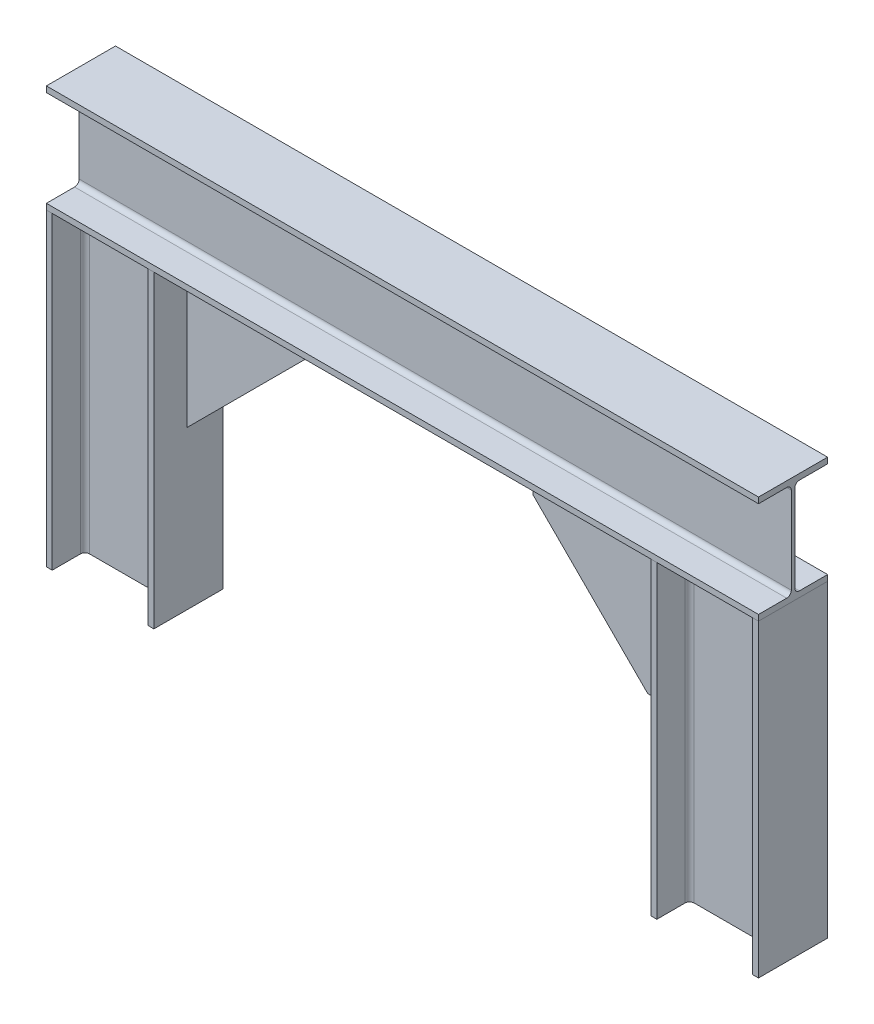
ISO-10303-21;
HEADER;
FILE_DESCRIPTION(('STEP AP214'),'2;1');
FILE_NAME('part.step','',(''),(''),'','','');
FILE_SCHEMA(('AUTOMOTIVE_DESIGN { 1 0 10303 214 1 1 1 1 }'));
ENDSEC;
DATA;
#1=APPLICATION_CONTEXT('core data for automotive mechanical design processes');
#2=APPLICATION_PROTOCOL_DEFINITION('international standard','automotive_design',2000,#1);
#3=PRODUCT_CONTEXT('',#1,'mechanical');
#4=PRODUCT('Part','Part','',(#3));
#5=PRODUCT_RELATED_PRODUCT_CATEGORY('part','',(#4));
#6=PRODUCT_DEFINITION_FORMATION('','',#4);
#7=PRODUCT_DEFINITION_CONTEXT('part definition',#1,'design');
#8=PRODUCT_DEFINITION('design','',#6,#7);
#9=PRODUCT_DEFINITION_SHAPE('','',#8);
#10=(LENGTH_UNIT() NAMED_UNIT(*) SI_UNIT(.MILLI.,.METRE.));
#11=(NAMED_UNIT(*) PLANE_ANGLE_UNIT() SI_UNIT($,.RADIAN.));
#12=(NAMED_UNIT(*) SI_UNIT($,.STERADIAN.) SOLID_ANGLE_UNIT());
#13=UNCERTAINTY_MEASURE_WITH_UNIT(LENGTH_MEASURE(1.E-05),#10,'distance_accuracy_value','');
#14=(GEOMETRIC_REPRESENTATION_CONTEXT(3) GLOBAL_UNCERTAINTY_ASSIGNED_CONTEXT((#13)) GLOBAL_UNIT_ASSIGNED_CONTEXT((#10,
#11,#12)) REPRESENTATION_CONTEXT('',''));
#15=CARTESIAN_POINT('',(0.,0.,0.));
#16=DIRECTION('',(0.,0.,1.));
#17=DIRECTION('',(1.,0.,0.));
#18=AXIS2_PLACEMENT_3D('',#15,#16,#17);
#19=CARTESIAN_POINT('',(571.628,-600.,-10.5409999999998));
#20=DIRECTION('',(0.,-1.,0.));
#21=DIRECTION('',(1.,0.,0.));
#22=AXIS2_PLACEMENT_3D('',#19,#20,#21);
#23=PLANE('',#22);
#24=DIRECTION('',(0.,0.,1.));
#25=VECTOR('',#24,1.);
#26=CARTESIAN_POINT('',(588.9,-600.,57.1500000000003));
#27=LINE('',#26,#25);
#28=CARTESIAN_POINT('',(588.9,-600.,-57.1499999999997));
#29=VERTEX_POINT('',#28);
#30=CARTESIAN_POINT('',(588.9,-600.,57.1500000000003));
#31=VERTEX_POINT('',#30);
#32=EDGE_CURVE('E549',#29,#31,#27,.T.);
#33=ORIENTED_EDGE('',*,*,#32,.T.);
#34=DIRECTION('',(-1.,0.,0.));
#35=VECTOR('',#34,1.);
#36=CARTESIAN_POINT('',(579.248,-600.,57.1500000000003));
#37=LINE('',#36,#35);
#38=CARTESIAN_POINT('',(579.248,-600.,57.1500000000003));
#39=VERTEX_POINT('',#38);
#40=EDGE_CURVE('E547',#31,#39,#37,.T.);
#41=ORIENTED_EDGE('',*,*,#40,.T.);
#42=DIRECTION('',(0.,0.,-1.));
#43=VECTOR('',#42,1.);
#44=CARTESIAN_POINT('',(579.248,-600.,10.5410000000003));
#45=LINE('',#44,#43);
#46=CARTESIAN_POINT('',(579.248,-600.,10.5410000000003));
#47=VERTEX_POINT('',#46);
#48=EDGE_CURVE('E545',#39,#47,#45,.T.);
#49=ORIENTED_EDGE('',*,*,#48,.T.);
#50=CARTESIAN_POINT('',(571.628,-600.,10.5410000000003));
#51=DIRECTION('',(0.,1.,0.));
#52=DIRECTION('',(1.,0.,0.));
#53=AXIS2_PLACEMENT_3D('',#50,#51,#52);
#54=CIRCLE('',#53,7.62000000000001);
#55=CARTESIAN_POINT('',(571.628,-600.,2.92100000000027));
#56=VERTEX_POINT('',#55);
#57=EDGE_CURVE('E543',#47,#56,#54,.T.);
#58=ORIENTED_EDGE('',*,*,#57,.T.);
#59=DIRECTION('',(-1.,0.,0.));
#60=VECTOR('',#59,1.);
#61=CARTESIAN_POINT('',(428.372,-600.,2.92099999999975));
#62=LINE('',#61,#60);
#63=CARTESIAN_POINT('',(428.372,-600.,2.92099999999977));
#64=VERTEX_POINT('',#63);
#65=EDGE_CURVE('E541',#56,#64,#62,.T.);
#66=ORIENTED_EDGE('',*,*,#65,.T.);
#67=CARTESIAN_POINT('',(428.372,-600.,10.5409999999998));
#68=DIRECTION('',(0.,1.,0.));
#69=DIRECTION('',(1.,0.,0.));
#70=AXIS2_PLACEMENT_3D('',#67,#68,#69);
#71=CIRCLE('',#70,7.61999999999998);
#72=CARTESIAN_POINT('',(420.752,-600.,10.5409999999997));
#73=VERTEX_POINT('',#72);
#74=EDGE_CURVE('E539',#64,#73,#71,.T.);
#75=ORIENTED_EDGE('',*,*,#74,.T.);
#76=DIRECTION('',(0.,0.,1.));
#77=VECTOR('',#76,1.);
#78=CARTESIAN_POINT('',(420.752,-600.,57.1499999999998));
#79=LINE('',#78,#77);
#80=CARTESIAN_POINT('',(420.752,-600.,57.1499999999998));
#81=VERTEX_POINT('',#80);
#82=EDGE_CURVE('E537',#73,#81,#79,.T.);
#83=ORIENTED_EDGE('',*,*,#82,.T.);
#84=DIRECTION('',(-1.,0.,0.));
#85=VECTOR('',#84,1.);
#86=CARTESIAN_POINT('',(411.1,-600.,57.1499999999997));
#87=LINE('',#86,#85);
#88=CARTESIAN_POINT('',(411.1,-600.,57.1499999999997));
#89=VERTEX_POINT('',#88);
#90=EDGE_CURVE('E535',#81,#89,#87,.T.);
#91=ORIENTED_EDGE('',*,*,#90,.T.);
#92=DIRECTION('',(0.,0.,-1.));
#93=VECTOR('',#92,1.);
#94=CARTESIAN_POINT('',(411.1,-600.,-57.1500000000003));
#95=LINE('',#94,#93);
#96=CARTESIAN_POINT('',(411.1,-600.,-57.1500000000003));
#97=VERTEX_POINT('',#96);
#98=EDGE_CURVE('E533',#89,#97,#95,.T.);
#99=ORIENTED_EDGE('',*,*,#98,.T.);
#100=DIRECTION('',(1.,0.,0.));
#101=VECTOR('',#100,1.);
#102=CARTESIAN_POINT('',(420.752,-600.,-57.1500000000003));
#103=LINE('',#102,#101);
#104=CARTESIAN_POINT('',(420.752,-600.,-57.1500000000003));
#105=VERTEX_POINT('',#104);
#106=EDGE_CURVE('E531',#97,#105,#103,.T.);
#107=ORIENTED_EDGE('',*,*,#106,.T.);
#108=DIRECTION('',(0.,0.,1.));
#109=VECTOR('',#108,1.);
#110=CARTESIAN_POINT('',(420.752,-600.,-10.5410000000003));
#111=LINE('',#110,#109);
#112=CARTESIAN_POINT('',(420.752,-600.,-10.5410000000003));
#113=VERTEX_POINT('',#112);
#114=EDGE_CURVE('E529',#105,#113,#111,.T.);
#115=ORIENTED_EDGE('',*,*,#114,.T.);
#116=CARTESIAN_POINT('',(428.372,-600.,-10.5410000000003));
#117=DIRECTION('',(0.,1.,0.));
#118=DIRECTION('',(1.,0.,0.));
#119=AXIS2_PLACEMENT_3D('',#116,#117,#118);
#120=CIRCLE('',#119,7.62000000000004);
#121=CARTESIAN_POINT('',(428.372,-600.,-2.92100000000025));
#122=VERTEX_POINT('',#121);
#123=EDGE_CURVE('E527',#113,#122,#120,.T.);
#124=ORIENTED_EDGE('',*,*,#123,.T.);
#125=DIRECTION('',(1.,0.,0.));
#126=VECTOR('',#125,1.);
#127=CARTESIAN_POINT('',(571.628,-600.,-2.92099999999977));
#128=LINE('',#127,#126);
#129=CARTESIAN_POINT('',(571.628,-600.,-2.92099999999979));
#130=VERTEX_POINT('',#129);
#131=EDGE_CURVE('E525',#122,#130,#128,.T.);
#132=ORIENTED_EDGE('',*,*,#131,.T.);
#133=CARTESIAN_POINT('',(571.628,-600.,-10.5409999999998));
#134=DIRECTION('',(0.,1.,0.));
#135=DIRECTION('',(1.,0.,0.));
#136=AXIS2_PLACEMENT_3D('',#133,#134,#135);
#137=CIRCLE('',#136,7.61999999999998);
#138=CARTESIAN_POINT('',(579.248,-600.,-10.5409999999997));
#139=VERTEX_POINT('',#138);
#140=EDGE_CURVE('E523',#130,#139,#137,.T.);
#141=ORIENTED_EDGE('',*,*,#140,.T.);
#142=DIRECTION('',(0.,0.,-1.));
#143=VECTOR('',#142,1.);
#144=CARTESIAN_POINT('',(579.248,-600.,-57.1499999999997));
#145=LINE('',#144,#143);
#146=CARTESIAN_POINT('',(579.248,-600.,-57.1499999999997));
#147=VERTEX_POINT('',#146);
#148=EDGE_CURVE('E515',#139,#147,#145,.T.);
#149=ORIENTED_EDGE('',*,*,#148,.T.);
#150=DIRECTION('',(1.,0.,0.));
#151=VECTOR('',#150,1.);
#152=CARTESIAN_POINT('',(588.9,-600.,-57.1499999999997));
#153=LINE('',#152,#151);
#154=EDGE_CURVE('E511',#147,#29,#153,.T.);
#155=ORIENTED_EDGE('',*,*,#154,.T.);
#156=EDGE_LOOP('',(#33,#41,#49,#58,#66,#75,#83,#91,#99,#107,#115,#124,#132,#141,#149,#155));
#157=FACE_BOUND('',#156,.T.);
#158=ADVANCED_FACE('F368',(#157),#23,.T.);
#159=CARTESIAN_POINT('',(588.9,-600.,-57.1499999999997));
#160=DIRECTION('',(0.,0.,1.));
#161=DIRECTION('',(1.,0.,0.));
#162=AXIS2_PLACEMENT_3D('',#159,#160,#161);
#163=PLANE('',#162);
#164=DIRECTION('',(-1.,0.,0.));
#165=VECTOR('',#164,1.);
#166=CARTESIAN_POINT('',(588.9,-88.9,-57.1499999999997));
#167=LINE('',#166,#165);
#168=CARTESIAN_POINT('',(588.9,-88.9,-57.1499999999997));
#169=VERTEX_POINT('',#168);
#170=CARTESIAN_POINT('',(579.248,-88.8999999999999,-57.1500000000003));
#171=VERTEX_POINT('',#170);
#172=EDGE_CURVE('E489',#169,#171,#167,.T.);
#173=ORIENTED_EDGE('',*,*,#172,.F.);
#174=DIRECTION('',(0.,1.,0.));
#175=VECTOR('',#174,1.);
#176=CARTESIAN_POINT('',(588.9,-600.,-57.1499999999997));
#177=LINE('',#176,#175);
#178=EDGE_CURVE('E519',#29,#169,#177,.T.);
#179=ORIENTED_EDGE('',*,*,#178,.F.);
#180=ORIENTED_EDGE('',*,*,#154,.F.);
#181=DIRECTION('',(0.,1.,0.));
#182=VECTOR('',#181,1.);
#183=CARTESIAN_POINT('',(579.248,-600.,-57.1499999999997));
#184=LINE('',#183,#182);
#185=EDGE_CURVE('E504',#147,#171,#184,.T.);
#186=ORIENTED_EDGE('',*,*,#185,.T.);
#187=EDGE_LOOP('',(#173,#179,#180,#186));
#188=FACE_BOUND('',#187,.T.);
#189=ADVANCED_FACE('F510',(#188),#163,.F.);
#190=CARTESIAN_POINT('',(579.248,-600.,-57.1499999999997));
#191=DIRECTION('',(1.,0.,0.));
#192=DIRECTION('',(0.,0.,-1.));
#193=AXIS2_PLACEMENT_3D('',#190,#191,#192);
#194=PLANE('',#193);
#195=DIRECTION('',(0.,0.,1.));
#196=VECTOR('',#195,1.);
#197=CARTESIAN_POINT('',(579.248,-88.9,-57.149999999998));
#198=LINE('',#197,#196);
#199=CARTESIAN_POINT('',(579.248,-88.9000000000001,-10.5409999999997));
#200=VERTEX_POINT('',#199);
#201=EDGE_CURVE('E492',#171,#200,#198,.T.);
#202=ORIENTED_EDGE('',*,*,#201,.F.);
#203=ORIENTED_EDGE('',*,*,#185,.F.);
#204=ORIENTED_EDGE('',*,*,#148,.F.);
#205=DIRECTION('',(0.,1.,0.));
#206=VECTOR('',#205,1.);
#207=CARTESIAN_POINT('',(579.248,-600.,-10.5409999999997));
#208=LINE('',#207,#206);
#209=EDGE_CURVE('E507',#139,#200,#208,.T.);
#210=ORIENTED_EDGE('',*,*,#209,.T.);
#211=EDGE_LOOP('',(#202,#203,#204,#210));
#212=FACE_BOUND('',#211,.T.);
#213=ADVANCED_FACE('F502',(#212),#194,.F.);
#214=CARTESIAN_POINT('',(571.628,-600.,-10.5409999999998));
#215=DIRECTION('',(0.,1.,0.));
#216=DIRECTION('',(0.,0.,1.));
#217=AXIS2_PLACEMENT_3D('',#214,#215,#216);
#218=CYLINDRICAL_SURFACE('',#217,7.61999999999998);
#219=CARTESIAN_POINT('',(571.628,-88.9000000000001,-10.5409999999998));
#220=DIRECTION('',(0.,1.,0.));
#221=DIRECTION('',(0.,0.,1.));
#222=AXIS2_PLACEMENT_3D('',#219,#220,#221);
#223=CIRCLE('',#222,7.61999999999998);
#224=CARTESIAN_POINT('',(571.628,-88.9000000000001,-2.92099999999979));
#225=VERTEX_POINT('',#224);
#226=EDGE_CURVE('E508',#200,#225,#223,.F.);
#227=ORIENTED_EDGE('',*,*,#226,.F.);
#228=ORIENTED_EDGE('',*,*,#209,.F.);
#229=ORIENTED_EDGE('',*,*,#140,.F.);
#230=DIRECTION('',(0.,1.,0.));
#231=VECTOR('',#230,1.);
#232=CARTESIAN_POINT('',(571.628,-600.,-2.92099999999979));
#233=LINE('',#232,#231);
#234=EDGE_CURVE('E513',#130,#225,#233,.T.);
#235=ORIENTED_EDGE('',*,*,#234,.T.);
#236=EDGE_LOOP('',(#227,#228,#229,#235));
#237=FACE_BOUND('',#236,.T.);
#238=ADVANCED_FACE('F634',(#237),#218,.F.);
#239=CARTESIAN_POINT('',(571.628,-600.,-2.92099999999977));
#240=DIRECTION('',(0.,0.,1.));
#241=DIRECTION('',(1.,0.,0.));
#242=AXIS2_PLACEMENT_3D('',#239,#240,#241);
#243=PLANE('',#242);
#244=DIRECTION('',(-1.,0.,0.));
#245=VECTOR('',#244,1.);
#246=CARTESIAN_POINT('',(571.628,-88.9000000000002,-2.92099999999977));
#247=LINE('',#246,#245);
#248=CARTESIAN_POINT('',(428.372,-88.9000000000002,-2.92100000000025));
#249=VERTEX_POINT('',#248);
#250=EDGE_CURVE('E563',#225,#249,#247,.T.);
#251=ORIENTED_EDGE('',*,*,#250,.F.);
#252=ORIENTED_EDGE('',*,*,#234,.F.);
#253=ORIENTED_EDGE('',*,*,#131,.F.);
#254=DIRECTION('',(0.,1.,0.));
#255=VECTOR('',#254,1.);
#256=CARTESIAN_POINT('',(428.372,-600.,-2.92100000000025));
#257=LINE('',#256,#255);
#258=EDGE_CURVE('E595',#122,#249,#257,.T.);
#259=ORIENTED_EDGE('',*,*,#258,.T.);
#260=EDGE_LOOP('',(#251,#252,#253,#259));
#261=FACE_BOUND('',#260,.T.);
#262=ADVANCED_FACE('F635',(#261),#243,.F.);
#263=CARTESIAN_POINT('',(428.372,-600.,-10.5410000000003));
#264=DIRECTION('',(0.,1.,0.));
#265=DIRECTION('',(0.,0.,1.));
#266=AXIS2_PLACEMENT_3D('',#263,#264,#265);
#267=CYLINDRICAL_SURFACE('',#266,7.62000000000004);
#268=CARTESIAN_POINT('',(428.372,-88.9000000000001,-10.5410000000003));
#269=DIRECTION('',(0.,1.,0.));
#270=DIRECTION('',(0.,0.,1.));
#271=AXIS2_PLACEMENT_3D('',#268,#269,#270);
#272=CIRCLE('',#271,7.62000000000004);
#273=CARTESIAN_POINT('',(420.752,-88.9000000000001,-10.5410000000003));
#274=VERTEX_POINT('',#273);
#275=EDGE_CURVE('E406',#249,#274,#272,.F.);
#276=ORIENTED_EDGE('',*,*,#275,.F.);
#277=ORIENTED_EDGE('',*,*,#258,.F.);
#278=ORIENTED_EDGE('',*,*,#123,.F.);
#279=DIRECTION('',(0.,1.,0.));
#280=VECTOR('',#279,1.);
#281=CARTESIAN_POINT('',(420.752,-600.,-10.5410000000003));
#282=LINE('',#281,#280);
#283=EDGE_CURVE('E372',#113,#274,#282,.T.);
#284=ORIENTED_EDGE('',*,*,#283,.T.);
#285=EDGE_LOOP('',(#276,#277,#278,#284));
#286=FACE_BOUND('',#285,.T.);
#287=ADVANCED_FACE('F637',(#286),#267,.F.);
#288=CARTESIAN_POINT('',(420.752,-600.,-10.5410000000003));
#289=DIRECTION('',(-1.,0.,0.));
#290=DIRECTION('',(0.,0.,1.));
#291=AXIS2_PLACEMENT_3D('',#288,#289,#290);
#292=PLANE('',#291);
#293=DIRECTION('',(0.,0.,-1.));
#294=VECTOR('',#293,1.);
#295=CARTESIAN_POINT('',(420.752,-88.9000000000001,-10.5409999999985));
#296=LINE('',#295,#294);
#297=CARTESIAN_POINT('',(420.752,-88.8999999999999,-57.1500000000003));
#298=VERTEX_POINT('',#297);
#299=EDGE_CURVE('E400',#274,#298,#296,.T.);
#300=ORIENTED_EDGE('',*,*,#299,.F.);
#301=ORIENTED_EDGE('',*,*,#283,.F.);
#302=ORIENTED_EDGE('',*,*,#114,.F.);
#303=DIRECTION('',(0.,1.,0.));
#304=VECTOR('',#303,1.);
#305=CARTESIAN_POINT('',(420.752,-600.,-57.1500000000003));
#306=LINE('',#305,#304);
#307=EDGE_CURVE('E589',#105,#298,#306,.T.);
#308=ORIENTED_EDGE('',*,*,#307,.T.);
#309=EDGE_LOOP('',(#300,#301,#302,#308));
#310=FACE_BOUND('',#309,.T.);
#311=ADVANCED_FACE('F643',(#310),#292,.F.);
#312=CARTESIAN_POINT('',(420.752,-600.,-57.1500000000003));
#313=DIRECTION('',(0.,0.,1.));
#314=DIRECTION('',(1.,0.,0.));
#315=AXIS2_PLACEMENT_3D('',#312,#313,#314);
#316=PLANE('',#315);
#317=DIRECTION('',(-1.,0.,0.));
#318=VECTOR('',#317,1.);
#319=CARTESIAN_POINT('',(500.,-88.8999999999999,-57.1500000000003));
#320=LINE('',#319,#318);
#321=CARTESIAN_POINT('',(411.1,-88.8999999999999,-57.1500000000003));
#322=VERTEX_POINT('',#321);
#323=EDGE_CURVE('E560',#298,#322,#320,.T.);
#324=ORIENTED_EDGE('',*,*,#323,.F.);
#325=ORIENTED_EDGE('',*,*,#307,.F.);
#326=ORIENTED_EDGE('',*,*,#106,.F.);
#327=DIRECTION('',(0.,1.,0.));
#328=VECTOR('',#327,1.);
#329=CARTESIAN_POINT('',(411.1,-600.,-57.1500000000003));
#330=LINE('',#329,#328);
#331=EDGE_CURVE('E587',#97,#322,#330,.T.);
#332=ORIENTED_EDGE('',*,*,#331,.T.);
#333=EDGE_LOOP('',(#324,#325,#326,#332));
#334=FACE_BOUND('',#333,.T.);
#335=ADVANCED_FACE('F689',(#334),#316,.F.);
#336=CARTESIAN_POINT('',(411.1,-600.,-57.1500000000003));
#337=DIRECTION('',(1.,0.,0.));
#338=DIRECTION('',(0.,0.,-1.));
#339=AXIS2_PLACEMENT_3D('',#336,#337,#338);
#340=PLANE('',#339);
#341=DIRECTION('',(0.,0.,1.));
#342=VECTOR('',#341,1.);
#343=CARTESIAN_POINT('',(411.1,-88.9,-57.1499999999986));
#344=LINE('',#343,#342);
#345=CARTESIAN_POINT('',(411.1,-88.9000000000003,57.1499999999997));
#346=VERTEX_POINT('',#345);
#347=EDGE_CURVE('E558',#322,#346,#344,.T.);
#348=ORIENTED_EDGE('',*,*,#347,.F.);
#349=ORIENTED_EDGE('',*,*,#331,.F.);
#350=ORIENTED_EDGE('',*,*,#98,.F.);
#351=DIRECTION('',(0.,1.,0.));
#352=VECTOR('',#351,1.);
#353=CARTESIAN_POINT('',(411.1,-600.,57.1499999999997));
#354=LINE('',#353,#352);
#355=EDGE_CURVE('E568',#89,#346,#354,.T.);
#356=ORIENTED_EDGE('',*,*,#355,.T.);
#357=EDGE_LOOP('',(#348,#349,#350,#356));
#358=FACE_BOUND('',#357,.T.);
#359=ADVANCED_FACE('F698',(#358),#340,.F.);
#360=CARTESIAN_POINT('',(411.1,-600.,57.1499999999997));
#361=DIRECTION('',(0.,0.,-1.));
#362=DIRECTION('',(-1.,0.,0.));
#363=AXIS2_PLACEMENT_3D('',#360,#361,#362);
#364=PLANE('',#363);
#365=DIRECTION('',(-1.,0.,0.));
#366=VECTOR('',#365,1.);
#367=CARTESIAN_POINT('',(500.,-88.9000000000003,57.1499999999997));
#368=LINE('',#367,#366);
#369=CARTESIAN_POINT('',(420.752,-88.9000000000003,57.1499999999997));
#370=VERTEX_POINT('',#369);
#371=EDGE_CURVE('E423',#370,#346,#368,.T.);
#372=ORIENTED_EDGE('',*,*,#371,.T.);
#373=ORIENTED_EDGE('',*,*,#355,.F.);
#374=ORIENTED_EDGE('',*,*,#90,.F.);
#375=DIRECTION('',(0.,1.,0.));
#376=VECTOR('',#375,1.);
#377=CARTESIAN_POINT('',(420.752,-600.,57.1499999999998));
#378=LINE('',#377,#376);
#379=EDGE_CURVE('E567',#81,#370,#378,.T.);
#380=ORIENTED_EDGE('',*,*,#379,.T.);
#381=EDGE_LOOP('',(#372,#373,#374,#380));
#382=FACE_BOUND('',#381,.T.);
#383=ADVANCED_FACE('F708',(#382),#364,.F.);
#384=CARTESIAN_POINT('',(420.752,-600.,57.1499999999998));
#385=DIRECTION('',(-1.,0.,0.));
#386=DIRECTION('',(0.,0.,1.));
#387=AXIS2_PLACEMENT_3D('',#384,#385,#386);
#388=PLANE('',#387);
#389=DIRECTION('',(0.,0.,-1.));
#390=VECTOR('',#389,1.);
#391=CARTESIAN_POINT('',(420.752,-88.9000000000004,57.1500000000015));
#392=LINE('',#391,#390);
#393=CARTESIAN_POINT('',(420.752,-88.9000000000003,10.5409999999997));
#394=VERTEX_POINT('',#393);
#395=EDGE_CURVE('E427',#370,#394,#392,.T.);
#396=ORIENTED_EDGE('',*,*,#395,.F.);
#397=ORIENTED_EDGE('',*,*,#379,.F.);
#398=ORIENTED_EDGE('',*,*,#82,.F.);
#399=DIRECTION('',(0.,1.,0.));
#400=VECTOR('',#399,1.);
#401=CARTESIAN_POINT('',(420.752,-600.,10.5409999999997));
#402=LINE('',#401,#400);
#403=EDGE_CURVE('E579',#73,#394,#402,.T.);
#404=ORIENTED_EDGE('',*,*,#403,.T.);
#405=EDGE_LOOP('',(#396,#397,#398,#404));
#406=FACE_BOUND('',#405,.T.);
#407=ADVANCED_FACE('F718',(#406),#388,.F.);
#408=CARTESIAN_POINT('',(428.372,-600.,10.5409999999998));
#409=DIRECTION('',(0.,1.,0.));
#410=DIRECTION('',(0.,0.,1.));
#411=AXIS2_PLACEMENT_3D('',#408,#409,#410);
#412=CYLINDRICAL_SURFACE('',#411,7.61999999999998);
#413=CARTESIAN_POINT('',(428.372,-88.9000000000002,10.5409999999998));
#414=DIRECTION('',(0.,1.,0.));
#415=DIRECTION('',(0.,0.,1.));
#416=AXIS2_PLACEMENT_3D('',#413,#414,#415);
#417=CIRCLE('',#416,7.61999999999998);
#418=CARTESIAN_POINT('',(428.372,-88.9000000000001,2.92099999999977));
#419=VERTEX_POINT('',#418);
#420=EDGE_CURVE('E431',#394,#419,#417,.F.);
#421=ORIENTED_EDGE('',*,*,#420,.F.);
#422=ORIENTED_EDGE('',*,*,#403,.F.);
#423=ORIENTED_EDGE('',*,*,#74,.F.);
#424=DIRECTION('',(0.,1.,0.));
#425=VECTOR('',#424,1.);
#426=CARTESIAN_POINT('',(428.372,-600.,2.92099999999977));
#427=LINE('',#426,#425);
#428=EDGE_CURVE('E582',#64,#419,#427,.T.);
#429=ORIENTED_EDGE('',*,*,#428,.T.);
#430=EDGE_LOOP('',(#421,#422,#423,#429));
#431=FACE_BOUND('',#430,.T.);
#432=ADVANCED_FACE('F728',(#431),#412,.F.);
#433=CARTESIAN_POINT('',(428.372,-600.,2.92099999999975));
#434=DIRECTION('',(0.,0.,-1.));
#435=DIRECTION('',(-1.,0.,0.));
#436=AXIS2_PLACEMENT_3D('',#433,#434,#435);
#437=PLANE('',#436);
#438=DIRECTION('',(1.,0.,0.));
#439=VECTOR('',#438,1.);
#440=CARTESIAN_POINT('',(428.372,-88.9000000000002,2.92099999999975));
#441=LINE('',#440,#439);
#442=CARTESIAN_POINT('',(571.628,-88.9000000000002,2.92100000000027));
#443=VERTEX_POINT('',#442);
#444=EDGE_CURVE('E554',#419,#443,#441,.T.);
#445=ORIENTED_EDGE('',*,*,#444,.F.);
#446=ORIENTED_EDGE('',*,*,#428,.F.);
#447=ORIENTED_EDGE('',*,*,#65,.F.);
#448=DIRECTION('',(0.,1.,0.));
#449=VECTOR('',#448,1.);
#450=CARTESIAN_POINT('',(571.628,-600.,2.92100000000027));
#451=LINE('',#450,#449);
#452=EDGE_CURVE('E578',#56,#443,#451,.T.);
#453=ORIENTED_EDGE('',*,*,#452,.T.);
#454=EDGE_LOOP('',(#445,#446,#447,#453));
#455=FACE_BOUND('',#454,.T.);
#456=ADVANCED_FACE('F613',(#455),#437,.F.);
#457=CARTESIAN_POINT('',(571.628,-600.,10.5410000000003));
#458=DIRECTION('',(0.,1.,0.));
#459=DIRECTION('',(0.,0.,1.));
#460=AXIS2_PLACEMENT_3D('',#457,#458,#459);
#461=CYLINDRICAL_SURFACE('',#460,7.62000000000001);
#462=CARTESIAN_POINT('',(571.628,-88.9000000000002,10.5410000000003));
#463=DIRECTION('',(0.,1.,0.));
#464=DIRECTION('',(0.,0.,1.));
#465=AXIS2_PLACEMENT_3D('',#462,#463,#464);
#466=CIRCLE('',#465,7.62000000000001);
#467=CARTESIAN_POINT('',(579.248,-88.9000000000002,10.5410000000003));
#468=VERTEX_POINT('',#467);
#469=EDGE_CURVE('E378',#443,#468,#466,.F.);
#470=ORIENTED_EDGE('',*,*,#469,.F.);
#471=ORIENTED_EDGE('',*,*,#452,.F.);
#472=ORIENTED_EDGE('',*,*,#57,.F.);
#473=DIRECTION('',(0.,1.,0.));
#474=VECTOR('',#473,1.);
#475=CARTESIAN_POINT('',(579.248,-600.,10.5410000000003));
#476=LINE('',#475,#474);
#477=EDGE_CURVE('E575',#47,#468,#476,.T.);
#478=ORIENTED_EDGE('',*,*,#477,.T.);
#479=EDGE_LOOP('',(#470,#471,#472,#478));
#480=FACE_BOUND('',#479,.T.);
#481=ADVANCED_FACE('F618',(#480),#461,.F.);
#482=CARTESIAN_POINT('',(579.248,-600.,10.5410000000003));
#483=DIRECTION('',(1.,0.,0.));
#484=DIRECTION('',(0.,0.,-1.));
#485=AXIS2_PLACEMENT_3D('',#482,#483,#484);
#486=PLANE('',#485);
#487=DIRECTION('',(0.,0.,1.));
#488=VECTOR('',#487,1.);
#489=CARTESIAN_POINT('',(579.248,-88.9000000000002,10.541000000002));
#490=LINE('',#489,#488);
#491=CARTESIAN_POINT('',(579.248,-88.9000000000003,57.1499999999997));
#492=VERTEX_POINT('',#491);
#493=EDGE_CURVE('E14',#468,#492,#490,.T.);
#494=ORIENTED_EDGE('',*,*,#493,.F.);
#495=ORIENTED_EDGE('',*,*,#477,.F.);
#496=ORIENTED_EDGE('',*,*,#48,.F.);
#497=DIRECTION('',(0.,1.,0.));
#498=VECTOR('',#497,1.);
#499=CARTESIAN_POINT('',(579.248,-600.,57.1500000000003));
#500=LINE('',#499,#498);
#501=EDGE_CURVE('E572',#39,#492,#500,.T.);
#502=ORIENTED_EDGE('',*,*,#501,.T.);
#503=EDGE_LOOP('',(#494,#495,#496,#502));
#504=FACE_BOUND('',#503,.T.);
#505=ADVANCED_FACE('F622',(#504),#486,.F.);
#506=CARTESIAN_POINT('',(579.248,-600.,57.1500000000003));
#507=DIRECTION('',(0.,0.,-1.));
#508=DIRECTION('',(-1.,0.,0.));
#509=AXIS2_PLACEMENT_3D('',#506,#507,#508);
#510=PLANE('',#509);
#511=CARTESIAN_POINT('',(588.9,-88.9000000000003,57.1499999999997));
#512=VERTEX_POINT('',#511);
#513=EDGE_CURVE('E386',#512,#492,#368,.T.);
#514=ORIENTED_EDGE('',*,*,#513,.T.);
#515=ORIENTED_EDGE('',*,*,#501,.F.);
#516=ORIENTED_EDGE('',*,*,#40,.F.);
#517=DIRECTION('',(0.,1.,0.));
#518=VECTOR('',#517,1.);
#519=CARTESIAN_POINT('',(588.9,-600.,57.1500000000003));
#520=LINE('',#519,#518);
#521=EDGE_CURVE('E520',#31,#512,#520,.T.);
#522=ORIENTED_EDGE('',*,*,#521,.T.);
#523=EDGE_LOOP('',(#514,#515,#516,#522));
#524=FACE_BOUND('',#523,.T.);
#525=ADVANCED_FACE('F626',(#524),#510,.F.);
#526=CARTESIAN_POINT('',(588.9,-600.,57.1500000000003));
#527=DIRECTION('',(-1.,0.,0.));
#528=DIRECTION('',(0.,0.,1.));
#529=AXIS2_PLACEMENT_3D('',#526,#527,#528);
#530=PLANE('',#529);
#531=DIRECTION('',(0.,0.,-1.));
#532=VECTOR('',#531,1.);
#533=CARTESIAN_POINT('',(588.9,-88.9000000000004,57.1500000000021));
#534=LINE('',#533,#532);
#535=EDGE_CURVE('E487',#512,#169,#534,.T.);
#536=ORIENTED_EDGE('',*,*,#535,.F.);
#537=ORIENTED_EDGE('',*,*,#521,.F.);
#538=ORIENTED_EDGE('',*,*,#32,.F.);
#539=ORIENTED_EDGE('',*,*,#178,.T.);
#540=EDGE_LOOP('',(#536,#537,#538,#539));
#541=FACE_BOUND('',#540,.T.);
#542=ADVANCED_FACE('F370',(#541),#530,.F.);
#543=CARTESIAN_POINT('',(500.,-88.8999999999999,-57.1500000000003));
#544=DIRECTION('',(0.,1.,0.));
#545=DIRECTION('',(0.,0.,1.));
#546=AXIS2_PLACEMENT_3D('',#543,#544,#545);
#547=PLANE('',#546);
#548=ORIENTED_EDGE('',*,*,#535,.T.);
#549=ORIENTED_EDGE('',*,*,#172,.T.);
#550=ORIENTED_EDGE('',*,*,#201,.T.);
#551=ORIENTED_EDGE('',*,*,#226,.T.);
#552=ORIENTED_EDGE('',*,*,#250,.T.);
#553=ORIENTED_EDGE('',*,*,#275,.T.);
#554=ORIENTED_EDGE('',*,*,#299,.T.);
#555=ORIENTED_EDGE('',*,*,#323,.T.);
#556=ORIENTED_EDGE('',*,*,#347,.T.);
#557=ORIENTED_EDGE('',*,*,#371,.F.);
#558=ORIENTED_EDGE('',*,*,#395,.T.);
#559=ORIENTED_EDGE('',*,*,#420,.T.);
#560=ORIENTED_EDGE('',*,*,#444,.T.);
#561=ORIENTED_EDGE('',*,*,#469,.T.);
#562=ORIENTED_EDGE('',*,*,#493,.T.);
#563=ORIENTED_EDGE('',*,*,#513,.F.);
#564=EDGE_LOOP('',(#548,#549,#550,#551,#552,#553,#554,#555,#556,#557,#558,#559,#560,#561,#562,#563));
#565=FACE_BOUND('',#564,.T.);
#566=ADVANCED_FACE('F491',(#565),#547,.T.);
#567=CLOSED_SHELL('',(#158,#189,#213,#238,#262,#287,#311,#335,#359,#383,#407,#432,#456,#481,
#505,#525,#542,#566));
#568=MANIFOLD_SOLID_BREP('B2',#567);
#569=CARTESIAN_POINT('',(500.,88.8999999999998,57.1500000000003));
#570=DIRECTION('',(0.,-1.,0.));
#571=DIRECTION('',(0.,0.,-1.));
#572=AXIS2_PLACEMENT_3D('',#569,#570,#571);
#573=PLANE('',#572);
#574=DIRECTION('',(0.,0.,1.));
#575=VECTOR('',#574,1.);
#576=CARTESIAN_POINT('',(588.9,88.8999999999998,57.1500000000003));
#577=LINE('',#576,#575);
#578=CARTESIAN_POINT('',(588.9,88.9000000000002,-57.1499999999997));
#579=VERTEX_POINT('',#578);
#580=CARTESIAN_POINT('',(588.9,88.8999999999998,57.1500000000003));
#581=VERTEX_POINT('',#580);
#582=EDGE_CURVE('E1052',#579,#581,#577,.T.);
#583=ORIENTED_EDGE('',*,*,#582,.F.);
#584=DIRECTION('',(-1.,0.,0.));
#585=VECTOR('',#584,1.);
#586=CARTESIAN_POINT('',(500.,88.9000000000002,-57.1499999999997));
#587=LINE('',#586,#585);
#588=CARTESIAN_POINT('',(-588.9,88.9000000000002,-57.1499999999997));
#589=VERTEX_POINT('',#588);
#590=EDGE_CURVE('E870',#579,#589,#587,.T.);
#591=ORIENTED_EDGE('',*,*,#590,.T.);
#592=DIRECTION('',(0.,0.,-1.));
#593=VECTOR('',#592,1.);
#594=CARTESIAN_POINT('',(-588.9,88.8999999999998,57.1500000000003));
#595=LINE('',#594,#593);
#596=CARTESIAN_POINT('',(-588.9,88.8999999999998,57.1500000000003));
#597=VERTEX_POINT('',#596);
#598=EDGE_CURVE('E1104',#597,#589,#595,.T.);
#599=ORIENTED_EDGE('',*,*,#598,.F.);
#600=DIRECTION('',(-1.,0.,0.));
#601=VECTOR('',#600,1.);
#602=CARTESIAN_POINT('',(500.,88.8999999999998,57.1500000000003));
#603=LINE('',#602,#601);
#604=EDGE_CURVE('E1096',#581,#597,#603,.T.);
#605=ORIENTED_EDGE('',*,*,#604,.F.);
#606=EDGE_LOOP('',(#583,#591,#599,#605));
#607=FACE_BOUND('',#606,.T.);
#608=ADVANCED_FACE('F866',(#607),#573,.F.);
#609=CARTESIAN_POINT('',(500.,79.2479999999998,57.1500000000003));
#610=DIRECTION('',(0.,0.,-1.));
#611=DIRECTION('',(0.,1.,0.));
#612=AXIS2_PLACEMENT_3D('',#609,#610,#611);
#613=PLANE('',#612);
#614=DIRECTION('',(0.,-1.,0.));
#615=VECTOR('',#614,1.);
#616=CARTESIAN_POINT('',(588.9,79.2479999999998,57.1500000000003));
#617=LINE('',#616,#615);
#618=CARTESIAN_POINT('',(588.9,79.2479999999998,57.1500000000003));
#619=VERTEX_POINT('',#618);
#620=EDGE_CURVE('E958',#581,#619,#617,.T.);
#621=ORIENTED_EDGE('',*,*,#620,.F.);
#622=ORIENTED_EDGE('',*,*,#604,.T.);
#623=DIRECTION('',(0.,1.,0.));
#624=VECTOR('',#623,1.);
#625=CARTESIAN_POINT('',(-588.9,79.248,57.1500000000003));
#626=LINE('',#625,#624);
#627=CARTESIAN_POINT('',(-588.9,79.2479999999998,57.1500000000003));
#628=VERTEX_POINT('',#627);
#629=EDGE_CURVE('E1062',#628,#597,#626,.T.);
#630=ORIENTED_EDGE('',*,*,#629,.F.);
#631=DIRECTION('',(-1.,0.,0.));
#632=VECTOR('',#631,1.);
#633=CARTESIAN_POINT('',(500.,79.2479999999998,57.1500000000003));
#634=LINE('',#633,#632);
#635=EDGE_CURVE('E1094',#619,#628,#634,.T.);
#636=ORIENTED_EDGE('',*,*,#635,.F.);
#637=EDGE_LOOP('',(#621,#622,#630,#636));
#638=FACE_BOUND('',#637,.T.);
#639=ADVANCED_FACE('F1100',(#638),#613,.F.);
#640=CARTESIAN_POINT('',(500.,79.2479999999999,10.5410000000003));
#641=DIRECTION('',(0.,1.,0.));
#642=DIRECTION('',(0.,0.,1.));
#643=AXIS2_PLACEMENT_3D('',#640,#641,#642);
#644=PLANE('',#643);
#645=DIRECTION('',(0.,0.,-1.));
#646=VECTOR('',#645,1.);
#647=CARTESIAN_POINT('',(588.9,79.2479999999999,10.5410000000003));
#648=LINE('',#647,#646);
#649=CARTESIAN_POINT('',(588.9,79.2479999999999,10.5410000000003));
#650=VERTEX_POINT('',#649);
#651=EDGE_CURVE('E1046',#619,#650,#648,.T.);
#652=ORIENTED_EDGE('',*,*,#651,.F.);
#653=ORIENTED_EDGE('',*,*,#635,.T.);
#654=DIRECTION('',(0.,0.,1.));
#655=VECTOR('',#654,1.);
#656=CARTESIAN_POINT('',(-588.9,79.2479999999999,10.5410000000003));
#657=LINE('',#656,#655);
#658=CARTESIAN_POINT('',(-588.9,79.2479999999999,10.5410000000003));
#659=VERTEX_POINT('',#658);
#660=EDGE_CURVE('E1059',#659,#628,#657,.T.);
#661=ORIENTED_EDGE('',*,*,#660,.F.);
#662=DIRECTION('',(-1.,0.,0.));
#663=VECTOR('',#662,1.);
#664=CARTESIAN_POINT('',(500.,79.2479999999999,10.5410000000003));
#665=LINE('',#664,#663);
#666=EDGE_CURVE('E1091',#650,#659,#665,.T.);
#667=ORIENTED_EDGE('',*,*,#666,.F.);
#668=EDGE_LOOP('',(#652,#653,#661,#667));
#669=FACE_BOUND('',#668,.T.);
#670=ADVANCED_FACE('F1178',(#669),#644,.F.);
#671=CARTESIAN_POINT('',(500.,71.6279999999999,10.5410000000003));
#672=DIRECTION('',(-1.,0.,0.));
#673=DIRECTION('',(0.,0.,1.));
#674=AXIS2_PLACEMENT_3D('',#671,#672,#673);
#675=CYLINDRICAL_SURFACE('',#674,7.61999999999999);
#676=CARTESIAN_POINT('',(588.9,71.6279999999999,10.5410000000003));
#677=DIRECTION('',(1.,0.,0.));
#678=DIRECTION('',(0.,1.,0.));
#679=AXIS2_PLACEMENT_3D('',#676,#677,#678);
#680=CIRCLE('',#679,7.61999999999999);
#681=CARTESIAN_POINT('',(588.9,71.628,2.92100000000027));
#682=VERTEX_POINT('',#681);
#683=EDGE_CURVE('E1042',#650,#682,#680,.F.);
#684=ORIENTED_EDGE('',*,*,#683,.F.);
#685=ORIENTED_EDGE('',*,*,#666,.T.);
#686=CARTESIAN_POINT('',(-588.9,71.6279999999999,10.5410000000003));
#687=DIRECTION('',(-1.,0.,0.));
#688=DIRECTION('',(0.,-1.,0.));
#689=AXIS2_PLACEMENT_3D('',#686,#687,#688);
#690=CIRCLE('',#689,7.61999999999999);
#691=CARTESIAN_POINT('',(-588.9,71.628,2.92100000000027));
#692=VERTEX_POINT('',#691);
#693=EDGE_CURVE('E1118',#692,#659,#690,.F.);
#694=ORIENTED_EDGE('',*,*,#693,.F.);
#695=DIRECTION('',(-1.,0.,0.));
#696=VECTOR('',#695,1.);
#697=CARTESIAN_POINT('',(500.,71.628,2.92100000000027));
#698=LINE('',#697,#696);
#699=EDGE_CURVE('E1088',#682,#692,#698,.T.);
#700=ORIENTED_EDGE('',*,*,#699,.F.);
#701=EDGE_LOOP('',(#684,#685,#694,#700));
#702=FACE_BOUND('',#701,.T.);
#703=ADVANCED_FACE('F1183',(#702),#675,.F.);
#704=CARTESIAN_POINT('',(500.,-71.628,2.92099999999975));
#705=DIRECTION('',(0.,0.,-1.));
#706=DIRECTION('',(0.,1.,0.));
#707=AXIS2_PLACEMENT_3D('',#704,#705,#706);
#708=PLANE('',#707);
#709=DIRECTION('',(0.,-1.,0.));
#710=VECTOR('',#709,1.);
#711=CARTESIAN_POINT('',(588.9,-71.628,2.92099999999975));
#712=LINE('',#711,#710);
#713=CARTESIAN_POINT('',(588.9,-71.628,2.92099999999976));
#714=VERTEX_POINT('',#713);
#715=EDGE_CURVE('E1038',#682,#714,#712,.T.);
#716=ORIENTED_EDGE('',*,*,#715,.F.);
#717=ORIENTED_EDGE('',*,*,#699,.T.);
#718=DIRECTION('',(0.,1.,0.));
#719=VECTOR('',#718,1.);
#720=CARTESIAN_POINT('',(-588.9,-71.6279999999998,2.92099999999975));
#721=LINE('',#720,#719);
#722=CARTESIAN_POINT('',(-588.9,-71.628,2.92099999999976));
#723=VERTEX_POINT('',#722);
#724=EDGE_CURVE('E1121',#723,#692,#721,.T.);
#725=ORIENTED_EDGE('',*,*,#724,.F.);
#726=DIRECTION('',(-1.,0.,0.));
#727=VECTOR('',#726,1.);
#728=CARTESIAN_POINT('',(500.,-71.628,2.92099999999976));
#729=LINE('',#728,#727);
#730=EDGE_CURVE('E1085',#714,#723,#729,.T.);
#731=ORIENTED_EDGE('',*,*,#730,.F.);
#732=EDGE_LOOP('',(#716,#717,#725,#731));
#733=FACE_BOUND('',#732,.T.);
#734=ADVANCED_FACE('F1187',(#733),#708,.F.);
#735=CARTESIAN_POINT('',(500.,-71.628,10.5409999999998));
#736=DIRECTION('',(-1.,0.,0.));
#737=DIRECTION('',(0.,0.,1.));
#738=AXIS2_PLACEMENT_3D('',#735,#736,#737);
#739=CYLINDRICAL_SURFACE('',#738,7.61999999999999);
#740=CARTESIAN_POINT('',(588.9,-71.628,10.5409999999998));
#741=DIRECTION('',(1.,0.,0.));
#742=DIRECTION('',(0.,1.,0.));
#743=AXIS2_PLACEMENT_3D('',#740,#741,#742);
#744=CIRCLE('',#743,7.61999999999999);
#745=CARTESIAN_POINT('',(588.9,-79.248,10.5409999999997));
#746=VERTEX_POINT('',#745);
#747=EDGE_CURVE('E1034',#714,#746,#744,.F.);
#748=ORIENTED_EDGE('',*,*,#747,.F.);
#749=ORIENTED_EDGE('',*,*,#730,.T.);
#750=CARTESIAN_POINT('',(-588.9,-71.628,10.5409999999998));
#751=DIRECTION('',(-1.,0.,0.));
#752=DIRECTION('',(0.,-1.,0.));
#753=AXIS2_PLACEMENT_3D('',#750,#751,#752);
#754=CIRCLE('',#753,7.61999999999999);
#755=CARTESIAN_POINT('',(-588.9,-79.248,10.5409999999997));
#756=VERTEX_POINT('',#755);
#757=EDGE_CURVE('E1125',#756,#723,#754,.F.);
#758=ORIENTED_EDGE('',*,*,#757,.F.);
#759=DIRECTION('',(-1.,0.,0.));
#760=VECTOR('',#759,1.);
#761=CARTESIAN_POINT('',(500.,-79.248,10.5409999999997));
#762=LINE('',#761,#760);
#763=EDGE_CURVE('E1082',#746,#756,#762,.T.);
#764=ORIENTED_EDGE('',*,*,#763,.F.);
#765=EDGE_LOOP('',(#748,#749,#758,#764));
#766=FACE_BOUND('',#765,.T.);
#767=ADVANCED_FACE('F1191',(#766),#739,.F.);
#768=CARTESIAN_POINT('',(500.,-79.2480000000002,57.1499999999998));
#769=DIRECTION('',(0.,-1.,0.));
#770=DIRECTION('',(0.,0.,-1.));
#771=AXIS2_PLACEMENT_3D('',#768,#769,#770);
#772=PLANE('',#771);
#773=DIRECTION('',(0.,0.,1.));
#774=VECTOR('',#773,1.);
#775=CARTESIAN_POINT('',(588.9,-79.2480000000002,57.1499999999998));
#776=LINE('',#775,#774);
#777=CARTESIAN_POINT('',(588.9,-79.2480000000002,57.1499999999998));
#778=VERTEX_POINT('',#777);
#779=EDGE_CURVE('E1030',#746,#778,#776,.T.);
#780=ORIENTED_EDGE('',*,*,#779,.F.);
#781=ORIENTED_EDGE('',*,*,#763,.T.);
#782=DIRECTION('',(0.,0.,-1.));
#783=VECTOR('',#782,1.);
#784=CARTESIAN_POINT('',(-588.9,-79.2480000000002,57.1499999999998));
#785=LINE('',#784,#783);
#786=CARTESIAN_POINT('',(-588.9,-79.2480000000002,57.1499999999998));
#787=VERTEX_POINT('',#786);
#788=EDGE_CURVE('E1129',#787,#756,#785,.T.);
#789=ORIENTED_EDGE('',*,*,#788,.F.);
#790=DIRECTION('',(-1.,0.,0.));
#791=VECTOR('',#790,1.);
#792=CARTESIAN_POINT('',(500.,-79.2480000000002,57.1499999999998));
#793=LINE('',#792,#791);
#794=EDGE_CURVE('E1079',#778,#787,#793,.T.);
#795=ORIENTED_EDGE('',*,*,#794,.F.);
#796=EDGE_LOOP('',(#780,#781,#789,#795));
#797=FACE_BOUND('',#796,.T.);
#798=ADVANCED_FACE('F1195',(#797),#772,.F.);
#799=CARTESIAN_POINT('',(500.,-88.9000000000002,57.1499999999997));
#800=DIRECTION('',(0.,0.,-1.));
#801=DIRECTION('',(0.,1.,0.));
#802=AXIS2_PLACEMENT_3D('',#799,#800,#801);
#803=PLANE('',#802);
#804=DIRECTION('',(0.,-1.,0.));
#805=VECTOR('',#804,1.);
#806=CARTESIAN_POINT('',(588.9,-88.9000000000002,57.1499999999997));
#807=LINE('',#806,#805);
#808=CARTESIAN_POINT('',(588.9,-88.9000000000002,57.1499999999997));
#809=VERTEX_POINT('',#808);
#810=EDGE_CURVE('E1026',#778,#809,#807,.T.);
#811=ORIENTED_EDGE('',*,*,#810,.F.);
#812=ORIENTED_EDGE('',*,*,#794,.T.);
#813=DIRECTION('',(0.,1.,0.));
#814=VECTOR('',#813,1.);
#815=CARTESIAN_POINT('',(-588.9,-88.9,57.1499999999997));
#816=LINE('',#815,#814);
#817=CARTESIAN_POINT('',(-588.9,-88.9000000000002,57.1499999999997));
#818=VERTEX_POINT('',#817);
#819=EDGE_CURVE('E1133',#818,#787,#816,.T.);
#820=ORIENTED_EDGE('',*,*,#819,.F.);
#821=DIRECTION('',(-1.,0.,0.));
#822=VECTOR('',#821,1.);
#823=CARTESIAN_POINT('',(500.,-88.9000000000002,57.1499999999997));
#824=LINE('',#823,#822);
#825=EDGE_CURVE('E1076',#809,#818,#824,.T.);
#826=ORIENTED_EDGE('',*,*,#825,.F.);
#827=EDGE_LOOP('',(#811,#812,#820,#826));
#828=FACE_BOUND('',#827,.T.);
#829=ADVANCED_FACE('F1199',(#828),#803,.F.);
#830=CARTESIAN_POINT('',(500.,-88.8999999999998,-57.1500000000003));
#831=DIRECTION('',(0.,1.,0.));
#832=DIRECTION('',(0.,0.,1.));
#833=AXIS2_PLACEMENT_3D('',#830,#831,#832);
#834=PLANE('',#833);
#835=DIRECTION('',(0.,0.,-1.));
#836=VECTOR('',#835,1.);
#837=CARTESIAN_POINT('',(588.9,-88.8999999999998,-57.1500000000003));
#838=LINE('',#837,#836);
#839=CARTESIAN_POINT('',(588.9,-88.8999999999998,-57.1500000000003));
#840=VERTEX_POINT('',#839);
#841=EDGE_CURVE('E1022',#809,#840,#838,.T.);
#842=ORIENTED_EDGE('',*,*,#841,.F.);
#843=ORIENTED_EDGE('',*,*,#825,.T.);
#844=DIRECTION('',(0.,0.,1.));
#845=VECTOR('',#844,1.);
#846=CARTESIAN_POINT('',(-588.9,-88.8999999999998,-57.1500000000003));
#847=LINE('',#846,#845);
#848=CARTESIAN_POINT('',(-588.9,-88.8999999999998,-57.1500000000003));
#849=VERTEX_POINT('',#848);
#850=EDGE_CURVE('E1137',#849,#818,#847,.T.);
#851=ORIENTED_EDGE('',*,*,#850,.F.);
#852=DIRECTION('',(-1.,0.,0.));
#853=VECTOR('',#852,1.);
#854=CARTESIAN_POINT('',(500.,-88.8999999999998,-57.1500000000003));
#855=LINE('',#854,#853);
#856=EDGE_CURVE('E1073',#840,#849,#855,.T.);
#857=ORIENTED_EDGE('',*,*,#856,.F.);
#858=EDGE_LOOP('',(#842,#843,#851,#857));
#859=FACE_BOUND('',#858,.T.);
#860=ADVANCED_FACE('F1203',(#859),#834,.F.);
#861=CARTESIAN_POINT('',(500.,-79.2479999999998,-57.1500000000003));
#862=DIRECTION('',(0.,0.,1.));
#863=DIRECTION('',(0.,-1.,0.));
#864=AXIS2_PLACEMENT_3D('',#861,#862,#863);
#865=PLANE('',#864);
#866=DIRECTION('',(0.,1.,0.));
#867=VECTOR('',#866,1.);
#868=CARTESIAN_POINT('',(588.9,-79.2479999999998,-57.1500000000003));
#869=LINE('',#868,#867);
#870=CARTESIAN_POINT('',(588.9,-79.2479999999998,-57.1500000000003));
#871=VERTEX_POINT('',#870);
#872=EDGE_CURVE('E1018',#840,#871,#869,.T.);
#873=ORIENTED_EDGE('',*,*,#872,.F.);
#874=ORIENTED_EDGE('',*,*,#856,.T.);
#875=DIRECTION('',(0.,-1.,0.));
#876=VECTOR('',#875,1.);
#877=CARTESIAN_POINT('',(-588.9,-79.2479999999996,-57.1500000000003));
#878=LINE('',#877,#876);
#879=CARTESIAN_POINT('',(-588.9,-79.2479999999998,-57.1500000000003));
#880=VERTEX_POINT('',#879);
#881=EDGE_CURVE('E1141',#880,#849,#878,.T.);
#882=ORIENTED_EDGE('',*,*,#881,.F.);
#883=DIRECTION('',(-1.,0.,0.));
#884=VECTOR('',#883,1.);
#885=CARTESIAN_POINT('',(500.,-79.2479999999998,-57.1500000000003));
#886=LINE('',#885,#884);
#887=EDGE_CURVE('E1070',#871,#880,#886,.T.);
#888=ORIENTED_EDGE('',*,*,#887,.F.);
#889=EDGE_LOOP('',(#873,#874,#882,#888));
#890=FACE_BOUND('',#889,.T.);
#891=ADVANCED_FACE('F1207',(#890),#865,.F.);
#892=CARTESIAN_POINT('',(500.,-79.2479999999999,-10.5410000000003));
#893=DIRECTION('',(0.,-1.,0.));
#894=DIRECTION('',(0.,0.,-1.));
#895=AXIS2_PLACEMENT_3D('',#892,#893,#894);
#896=PLANE('',#895);
#897=DIRECTION('',(0.,0.,1.));
#898=VECTOR('',#897,1.);
#899=CARTESIAN_POINT('',(588.9,-79.2479999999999,-10.5410000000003));
#900=LINE('',#899,#898);
#901=CARTESIAN_POINT('',(588.9,-79.2479999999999,-10.5410000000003));
#902=VERTEX_POINT('',#901);
#903=EDGE_CURVE('E1013',#871,#902,#900,.T.);
#904=ORIENTED_EDGE('',*,*,#903,.F.);
#905=ORIENTED_EDGE('',*,*,#887,.T.);
#906=DIRECTION('',(0.,0.,-1.));
#907=VECTOR('',#906,1.);
#908=CARTESIAN_POINT('',(-588.9,-79.2479999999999,-10.5410000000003));
#909=LINE('',#908,#907);
#910=CARTESIAN_POINT('',(-588.9,-79.2479999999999,-10.5410000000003));
#911=VERTEX_POINT('',#910);
#912=EDGE_CURVE('E1145',#911,#880,#909,.T.);
#913=ORIENTED_EDGE('',*,*,#912,.F.);
#914=DIRECTION('',(-1.,0.,0.));
#915=VECTOR('',#914,1.);
#916=CARTESIAN_POINT('',(500.,-79.2479999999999,-10.5410000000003));
#917=LINE('',#916,#915);
#918=EDGE_CURVE('E1067',#902,#911,#917,.T.);
#919=ORIENTED_EDGE('',*,*,#918,.F.);
#920=EDGE_LOOP('',(#904,#905,#913,#919));
#921=FACE_BOUND('',#920,.T.);
#922=ADVANCED_FACE('F1211',(#921),#896,.F.);
#923=CARTESIAN_POINT('',(500.,-71.6279999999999,-10.5410000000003));
#924=DIRECTION('',(-1.,0.,0.));
#925=DIRECTION('',(0.,0.,1.));
#926=AXIS2_PLACEMENT_3D('',#923,#924,#925);
#927=CYLINDRICAL_SURFACE('',#926,7.61999999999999);
#928=CARTESIAN_POINT('',(588.9,-71.6279999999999,-10.5410000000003));
#929=DIRECTION('',(1.,0.,0.));
#930=DIRECTION('',(0.,1.,0.));
#931=AXIS2_PLACEMENT_3D('',#928,#929,#930);
#932=CIRCLE('',#931,7.61999999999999);
#933=CARTESIAN_POINT('',(588.9,-71.628,-2.92100000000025));
#934=VERTEX_POINT('',#933);
#935=EDGE_CURVE('E1009',#902,#934,#932,.F.);
#936=ORIENTED_EDGE('',*,*,#935,.F.);
#937=ORIENTED_EDGE('',*,*,#918,.T.);
#938=CARTESIAN_POINT('',(-588.9,-71.6279999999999,-10.5410000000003));
#939=DIRECTION('',(-1.,0.,0.));
#940=DIRECTION('',(0.,-1.,0.));
#941=AXIS2_PLACEMENT_3D('',#938,#939,#940);
#942=CIRCLE('',#941,7.61999999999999);
#943=CARTESIAN_POINT('',(-588.9,-71.628,-2.92100000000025));
#944=VERTEX_POINT('',#943);
#945=EDGE_CURVE('E1149',#944,#911,#942,.F.);
#946=ORIENTED_EDGE('',*,*,#945,.F.);
#947=DIRECTION('',(-1.,0.,0.));
#948=VECTOR('',#947,1.);
#949=CARTESIAN_POINT('',(500.,-71.628,-2.92100000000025));
#950=LINE('',#949,#948);
#951=EDGE_CURVE('E1004',#934,#944,#950,.T.);
#952=ORIENTED_EDGE('',*,*,#951,.F.);
#953=EDGE_LOOP('',(#936,#937,#946,#952));
#954=FACE_BOUND('',#953,.T.);
#955=ADVANCED_FACE('F1215',(#954),#927,.F.);
#956=CARTESIAN_POINT('',(500.,71.628,-2.92099999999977));
#957=DIRECTION('',(0.,0.,1.));
#958=DIRECTION('',(0.,-1.,0.));
#959=AXIS2_PLACEMENT_3D('',#956,#957,#958);
#960=PLANE('',#959);
#961=DIRECTION('',(0.,1.,0.));
#962=VECTOR('',#961,1.);
#963=CARTESIAN_POINT('',(588.9,71.628,-2.92099999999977));
#964=LINE('',#963,#962);
#965=CARTESIAN_POINT('',(588.9,71.628,-2.92099999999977));
#966=VERTEX_POINT('',#965);
#967=EDGE_CURVE('E995',#934,#966,#964,.T.);
#968=ORIENTED_EDGE('',*,*,#967,.F.);
#969=ORIENTED_EDGE('',*,*,#951,.T.);
#970=DIRECTION('',(0.,-1.,0.));
#971=VECTOR('',#970,1.);
#972=CARTESIAN_POINT('',(-588.9,71.6280000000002,-2.92099999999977));
#973=LINE('',#972,#971);
#974=CARTESIAN_POINT('',(-588.9,71.628,-2.92099999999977));
#975=VERTEX_POINT('',#974);
#976=EDGE_CURVE('E1001',#975,#944,#973,.T.);
#977=ORIENTED_EDGE('',*,*,#976,.F.);
#978=DIRECTION('',(-1.,0.,0.));
#979=VECTOR('',#978,1.);
#980=CARTESIAN_POINT('',(500.,71.628,-2.92099999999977));
#981=LINE('',#980,#979);
#982=EDGE_CURVE('E989',#966,#975,#981,.T.);
#983=ORIENTED_EDGE('',*,*,#982,.F.);
#984=EDGE_LOOP('',(#968,#969,#977,#983));
#985=FACE_BOUND('',#984,.T.);
#986=ADVANCED_FACE('F998',(#985),#960,.F.);
#987=CARTESIAN_POINT('',(500.,71.628,-10.5409999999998));
#988=DIRECTION('',(-1.,0.,0.));
#989=DIRECTION('',(0.,0.,1.));
#990=AXIS2_PLACEMENT_3D('',#987,#988,#989);
#991=CYLINDRICAL_SURFACE('',#990,7.61999999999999);
#992=CARTESIAN_POINT('',(588.9,71.628,-10.5409999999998));
#993=DIRECTION('',(1.,0.,0.));
#994=DIRECTION('',(0.,1.,0.));
#995=AXIS2_PLACEMENT_3D('',#992,#993,#994);
#996=CIRCLE('',#995,7.61999999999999);
#997=CARTESIAN_POINT('',(588.9,79.248,-10.5409999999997));
#998=VERTEX_POINT('',#997);
#999=EDGE_CURVE('E876',#966,#998,#996,.F.);
#1000=ORIENTED_EDGE('',*,*,#999,.F.);
#1001=ORIENTED_EDGE('',*,*,#982,.T.);
#1002=CARTESIAN_POINT('',(-588.9,71.628,-10.5409999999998));
#1003=DIRECTION('',(-1.,0.,0.));
#1004=DIRECTION('',(0.,-1.,0.));
#1005=AXIS2_PLACEMENT_3D('',#1002,#1003,#1004);
#1006=CIRCLE('',#1005,7.61999999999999);
#1007=CARTESIAN_POINT('',(-588.9,79.248,-10.5409999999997));
#1008=VERTEX_POINT('',#1007);
#1009=EDGE_CURVE('E1155',#1008,#975,#1006,.F.);
#1010=ORIENTED_EDGE('',*,*,#1009,.F.);
#1011=DIRECTION('',(-1.,0.,0.));
#1012=VECTOR('',#1011,1.);
#1013=CARTESIAN_POINT('',(500.,79.248,-10.5409999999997));
#1014=LINE('',#1013,#1012);
#1015=EDGE_CURVE('E991',#998,#1008,#1014,.T.);
#1016=ORIENTED_EDGE('',*,*,#1015,.F.);
#1017=EDGE_LOOP('',(#1000,#1001,#1010,#1016));
#1018=FACE_BOUND('',#1017,.T.);
#1019=ADVANCED_FACE('F987',(#1018),#991,.F.);
#1020=CARTESIAN_POINT('',(500.,79.2480000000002,-57.1499999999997));
#1021=DIRECTION('',(0.,1.,0.));
#1022=DIRECTION('',(0.,0.,1.));
#1023=AXIS2_PLACEMENT_3D('',#1020,#1021,#1022);
#1024=PLANE('',#1023);
#1025=DIRECTION('',(0.,0.,-1.));
#1026=VECTOR('',#1025,1.);
#1027=CARTESIAN_POINT('',(588.9,79.2480000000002,-57.1499999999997));
#1028=LINE('',#1027,#1026);
#1029=CARTESIAN_POINT('',(588.9,79.2480000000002,-57.1499999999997));
#1030=VERTEX_POINT('',#1029);
#1031=EDGE_CURVE('E366',#998,#1030,#1028,.T.);
#1032=ORIENTED_EDGE('',*,*,#1031,.F.);
#1033=ORIENTED_EDGE('',*,*,#1015,.T.);
#1034=DIRECTION('',(0.,0.,1.));
#1035=VECTOR('',#1034,1.);
#1036=CARTESIAN_POINT('',(-588.9,79.2480000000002,-57.1499999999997));
#1037=LINE('',#1036,#1035);
#1038=CARTESIAN_POINT('',(-588.9,79.2480000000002,-57.1499999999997));
#1039=VERTEX_POINT('',#1038);
#1040=EDGE_CURVE('E1158',#1039,#1008,#1037,.T.);
#1041=ORIENTED_EDGE('',*,*,#1040,.F.);
#1042=DIRECTION('',(-1.,0.,0.));
#1043=VECTOR('',#1042,1.);
#1044=CARTESIAN_POINT('',(500.,79.2480000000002,-57.1499999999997));
#1045=LINE('',#1044,#1043);
#1046=EDGE_CURVE('E889',#1030,#1039,#1045,.T.);
#1047=ORIENTED_EDGE('',*,*,#1046,.F.);
#1048=EDGE_LOOP('',(#1032,#1033,#1041,#1047));
#1049=FACE_BOUND('',#1048,.T.);
#1050=ADVANCED_FACE('F1165',(#1049),#1024,.F.);
#1051=CARTESIAN_POINT('',(500.,88.9000000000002,-57.1499999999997));
#1052=DIRECTION('',(0.,0.,1.));
#1053=DIRECTION('',(0.,-1.,0.));
#1054=AXIS2_PLACEMENT_3D('',#1051,#1052,#1053);
#1055=PLANE('',#1054);
#1056=DIRECTION('',(0.,1.,0.));
#1057=VECTOR('',#1056,1.);
#1058=CARTESIAN_POINT('',(588.9,88.9000000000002,-57.1499999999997));
#1059=LINE('',#1058,#1057);
#1060=EDGE_CURVE('E1056',#1030,#579,#1059,.T.);
#1061=ORIENTED_EDGE('',*,*,#1060,.F.);
#1062=ORIENTED_EDGE('',*,*,#1046,.T.);
#1063=DIRECTION('',(0.,-1.,0.));
#1064=VECTOR('',#1063,1.);
#1065=CARTESIAN_POINT('',(-588.9,88.9000000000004,-57.1499999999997));
#1066=LINE('',#1065,#1064);
#1067=EDGE_CURVE('E1108',#589,#1039,#1066,.T.);
#1068=ORIENTED_EDGE('',*,*,#1067,.F.);
#1069=ORIENTED_EDGE('',*,*,#590,.F.);
#1070=EDGE_LOOP('',(#1061,#1062,#1068,#1069));
#1071=FACE_BOUND('',#1070,.T.);
#1072=ADVANCED_FACE('F1163',(#1071),#1055,.F.);
#1073=CARTESIAN_POINT('',(-588.9,0.,57.1500000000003));
#1074=DIRECTION('',(-1.,0.,0.));
#1075=DIRECTION('',(0.,-1.,0.));
#1076=AXIS2_PLACEMENT_3D('',#1073,#1074,#1075);
#1077=PLANE('',#1076);
#1078=ORIENTED_EDGE('',*,*,#629,.T.);
#1079=ORIENTED_EDGE('',*,*,#598,.T.);
#1080=ORIENTED_EDGE('',*,*,#1067,.T.);
#1081=ORIENTED_EDGE('',*,*,#1040,.T.);
#1082=ORIENTED_EDGE('',*,*,#1009,.T.);
#1083=ORIENTED_EDGE('',*,*,#976,.T.);
#1084=ORIENTED_EDGE('',*,*,#945,.T.);
#1085=ORIENTED_EDGE('',*,*,#912,.T.);
#1086=ORIENTED_EDGE('',*,*,#881,.T.);
#1087=ORIENTED_EDGE('',*,*,#850,.T.);
#1088=ORIENTED_EDGE('',*,*,#819,.T.);
#1089=ORIENTED_EDGE('',*,*,#788,.T.);
#1090=ORIENTED_EDGE('',*,*,#757,.T.);
#1091=ORIENTED_EDGE('',*,*,#724,.T.);
#1092=ORIENTED_EDGE('',*,*,#693,.T.);
#1093=ORIENTED_EDGE('',*,*,#660,.T.);
#1094=EDGE_LOOP('',(#1078,#1079,#1080,#1081,#1082,#1083,#1084,#1085,#1086,#1087,#1088,#1089,
#1090,#1091,#1092,#1093));
#1095=FACE_BOUND('',#1094,.T.);
#1096=ADVANCED_FACE('F1110',(#1095),#1077,.T.);
#1097=CARTESIAN_POINT('',(588.9,0.,-57.1500000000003));
#1098=DIRECTION('',(1.,0.,0.));
#1099=DIRECTION('',(0.,1.,0.));
#1100=AXIS2_PLACEMENT_3D('',#1097,#1098,#1099);
#1101=PLANE('',#1100);
#1102=ORIENTED_EDGE('',*,*,#1060,.T.);
#1103=ORIENTED_EDGE('',*,*,#582,.T.);
#1104=ORIENTED_EDGE('',*,*,#620,.T.);
#1105=ORIENTED_EDGE('',*,*,#651,.T.);
#1106=ORIENTED_EDGE('',*,*,#683,.T.);
#1107=ORIENTED_EDGE('',*,*,#715,.T.);
#1108=ORIENTED_EDGE('',*,*,#747,.T.);
#1109=ORIENTED_EDGE('',*,*,#779,.T.);
#1110=ORIENTED_EDGE('',*,*,#810,.T.);
#1111=ORIENTED_EDGE('',*,*,#841,.T.);
#1112=ORIENTED_EDGE('',*,*,#872,.T.);
#1113=ORIENTED_EDGE('',*,*,#903,.T.);
#1114=ORIENTED_EDGE('',*,*,#935,.T.);
#1115=ORIENTED_EDGE('',*,*,#967,.T.);
#1116=ORIENTED_EDGE('',*,*,#999,.T.);
#1117=ORIENTED_EDGE('',*,*,#1031,.T.);
#1118=EDGE_LOOP('',(#1102,#1103,#1104,#1105,#1106,#1107,#1108,#1109,#1110,#1111,#1112,#1113,
#1114,#1115,#1116,#1117));
#1119=FACE_BOUND('',#1118,.T.);
#1120=ADVANCED_FACE('F868',(#1119),#1101,.T.);
#1121=CLOSED_SHELL('',(#608,#639,#670,#703,#734,#767,#798,#829,#860,#891,#922,#955,#986,#1019,
#1050,#1072,#1096,#1120));
#1122=MANIFOLD_SOLID_BREP('B8',#1121);
#1123=CARTESIAN_POINT('',(-428.372,-600.,-10.5409999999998));
#1124=DIRECTION('',(0.,-1.,0.));
#1125=DIRECTION('',(1.,0.,0.));
#1126=AXIS2_PLACEMENT_3D('',#1123,#1124,#1125);
#1127=PLANE('',#1126);
#1128=DIRECTION('',(0.,0.,1.));
#1129=VECTOR('',#1128,1.);
#1130=CARTESIAN_POINT('',(-411.1,-600.,57.1500000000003));
#1131=LINE('',#1130,#1129);
#1132=CARTESIAN_POINT('',(-411.1,-600.,-57.1499999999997));
#1133=VERTEX_POINT('',#1132);
#1134=CARTESIAN_POINT('',(-411.1,-600.,57.1500000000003));
#1135=VERTEX_POINT('',#1134);
#1136=EDGE_CURVE('E1581',#1133,#1135,#1131,.T.);
#1137=ORIENTED_EDGE('',*,*,#1136,.T.);
#1138=DIRECTION('',(-1.,0.,0.));
#1139=VECTOR('',#1138,1.);
#1140=CARTESIAN_POINT('',(-420.752,-600.,57.1500000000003));
#1141=LINE('',#1140,#1139);
#1142=CARTESIAN_POINT('',(-420.752,-600.,57.1500000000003));
#1143=VERTEX_POINT('',#1142);
#1144=EDGE_CURVE('E1616',#1135,#1143,#1141,.T.);
#1145=ORIENTED_EDGE('',*,*,#1144,.T.);
#1146=DIRECTION('',(0.,0.,-1.));
#1147=VECTOR('',#1146,1.);
#1148=CARTESIAN_POINT('',(-420.752,-600.,10.5410000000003));
#1149=LINE('',#1148,#1147);
#1150=CARTESIAN_POINT('',(-420.752,-600.,10.5410000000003));
#1151=VERTEX_POINT('',#1150);
#1152=EDGE_CURVE('E1614',#1143,#1151,#1149,.T.);
#1153=ORIENTED_EDGE('',*,*,#1152,.T.);
#1154=CARTESIAN_POINT('',(-428.372,-600.,10.5410000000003));
#1155=DIRECTION('',(0.,1.,0.));
#1156=DIRECTION('',(1.,0.,0.));
#1157=AXIS2_PLACEMENT_3D('',#1154,#1155,#1156);
#1158=CIRCLE('',#1157,7.62000000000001);
#1159=CARTESIAN_POINT('',(-428.372,-600.,2.92100000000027));
#1160=VERTEX_POINT('',#1159);
#1161=EDGE_CURVE('E1612',#1151,#1160,#1158,.T.);
#1162=ORIENTED_EDGE('',*,*,#1161,.T.);
#1163=DIRECTION('',(-1.,0.,0.));
#1164=VECTOR('',#1163,1.);
#1165=CARTESIAN_POINT('',(-571.628,-600.,2.92099999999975));
#1166=LINE('',#1165,#1164);
#1167=CARTESIAN_POINT('',(-571.628,-600.,2.92099999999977));
#1168=VERTEX_POINT('',#1167);
#1169=EDGE_CURVE('E1610',#1160,#1168,#1166,.T.);
#1170=ORIENTED_EDGE('',*,*,#1169,.T.);
#1171=CARTESIAN_POINT('',(-571.628,-600.,10.5409999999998));
#1172=DIRECTION('',(0.,1.,0.));
#1173=DIRECTION('',(1.,0.,0.));
#1174=AXIS2_PLACEMENT_3D('',#1171,#1172,#1173);
#1175=CIRCLE('',#1174,7.61999999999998);
#1176=CARTESIAN_POINT('',(-579.248,-600.,10.5409999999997));
#1177=VERTEX_POINT('',#1176);
#1178=EDGE_CURVE('E1608',#1168,#1177,#1175,.T.);
#1179=ORIENTED_EDGE('',*,*,#1178,.T.);
#1180=DIRECTION('',(0.,0.,1.));
#1181=VECTOR('',#1180,1.);
#1182=CARTESIAN_POINT('',(-579.248,-600.,57.1499999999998));
#1183=LINE('',#1182,#1181);
#1184=CARTESIAN_POINT('',(-579.248,-600.,57.1499999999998));
#1185=VERTEX_POINT('',#1184);
#1186=EDGE_CURVE('E1606',#1177,#1185,#1183,.T.);
#1187=ORIENTED_EDGE('',*,*,#1186,.T.);
#1188=DIRECTION('',(-1.,0.,0.));
#1189=VECTOR('',#1188,1.);
#1190=CARTESIAN_POINT('',(-588.9,-600.,57.1499999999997));
#1191=LINE('',#1190,#1189);
#1192=CARTESIAN_POINT('',(-588.9,-600.,57.1499999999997));
#1193=VERTEX_POINT('',#1192);
#1194=EDGE_CURVE('E1604',#1185,#1193,#1191,.T.);
#1195=ORIENTED_EDGE('',*,*,#1194,.T.);
#1196=DIRECTION('',(0.,0.,-1.));
#1197=VECTOR('',#1196,1.);
#1198=CARTESIAN_POINT('',(-588.9,-600.,-57.1500000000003));
#1199=LINE('',#1198,#1197);
#1200=CARTESIAN_POINT('',(-588.9,-600.,-57.1500000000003));
#1201=VERTEX_POINT('',#1200);
#1202=EDGE_CURVE('E1602',#1193,#1201,#1199,.T.);
#1203=ORIENTED_EDGE('',*,*,#1202,.T.);
#1204=DIRECTION('',(1.,0.,0.));
#1205=VECTOR('',#1204,1.);
#1206=CARTESIAN_POINT('',(-579.248,-600.,-57.1500000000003));
#1207=LINE('',#1206,#1205);
#1208=CARTESIAN_POINT('',(-579.248,-600.,-57.1500000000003));
#1209=VERTEX_POINT('',#1208);
#1210=EDGE_CURVE('E1600',#1201,#1209,#1207,.T.);
#1211=ORIENTED_EDGE('',*,*,#1210,.T.);
#1212=DIRECTION('',(0.,0.,1.));
#1213=VECTOR('',#1212,1.);
#1214=CARTESIAN_POINT('',(-579.248,-600.,-10.5410000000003));
#1215=LINE('',#1214,#1213);
#1216=CARTESIAN_POINT('',(-579.248,-600.,-10.5410000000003));
#1217=VERTEX_POINT('',#1216);
#1218=EDGE_CURVE('E1598',#1209,#1217,#1215,.T.);
#1219=ORIENTED_EDGE('',*,*,#1218,.T.);
#1220=CARTESIAN_POINT('',(-571.628,-600.,-10.5410000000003));
#1221=DIRECTION('',(0.,1.,0.));
#1222=DIRECTION('',(1.,0.,0.));
#1223=AXIS2_PLACEMENT_3D('',#1220,#1221,#1222);
#1224=CIRCLE('',#1223,7.62000000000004);
#1225=CARTESIAN_POINT('',(-571.628,-600.,-2.92100000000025));
#1226=VERTEX_POINT('',#1225);
#1227=EDGE_CURVE('E1596',#1217,#1226,#1224,.T.);
#1228=ORIENTED_EDGE('',*,*,#1227,.T.);
#1229=DIRECTION('',(1.,0.,0.));
#1230=VECTOR('',#1229,1.);
#1231=CARTESIAN_POINT('',(-428.372,-600.,-2.92099999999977));
#1232=LINE('',#1231,#1230);
#1233=CARTESIAN_POINT('',(-428.372,-600.,-2.92099999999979));
#1234=VERTEX_POINT('',#1233);
#1235=EDGE_CURVE('E1594',#1226,#1234,#1232,.T.);
#1236=ORIENTED_EDGE('',*,*,#1235,.T.);
#1237=CARTESIAN_POINT('',(-428.372,-600.,-10.5409999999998));
#1238=DIRECTION('',(0.,1.,0.));
#1239=DIRECTION('',(1.,0.,0.));
#1240=AXIS2_PLACEMENT_3D('',#1237,#1238,#1239);
#1241=CIRCLE('',#1240,7.61999999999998);
#1242=CARTESIAN_POINT('',(-420.752,-600.,-10.5409999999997));
#1243=VERTEX_POINT('',#1242);
#1244=EDGE_CURVE('E1592',#1234,#1243,#1241,.T.);
#1245=ORIENTED_EDGE('',*,*,#1244,.T.);
#1246=DIRECTION('',(0.,0.,-1.));
#1247=VECTOR('',#1246,1.);
#1248=CARTESIAN_POINT('',(-420.752,-600.,-57.1499999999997));
#1249=LINE('',#1248,#1247);
#1250=CARTESIAN_POINT('',(-420.752,-600.,-57.1499999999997));
#1251=VERTEX_POINT('',#1250);
#1252=EDGE_CURVE('E1590',#1243,#1251,#1249,.T.);
#1253=ORIENTED_EDGE('',*,*,#1252,.T.);
#1254=DIRECTION('',(1.,0.,0.));
#1255=VECTOR('',#1254,1.);
#1256=CARTESIAN_POINT('',(-411.1,-600.,-57.1499999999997));
#1257=LINE('',#1256,#1255);
#1258=EDGE_CURVE('E1588',#1251,#1133,#1257,.T.);
#1259=ORIENTED_EDGE('',*,*,#1258,.T.);
#1260=EDGE_LOOP('',(#1137,#1145,#1153,#1162,#1170,#1179,#1187,#1195,#1203,#1211,#1219,#1228,
#1236,#1245,#1253,#1259));
#1261=FACE_BOUND('',#1260,.T.);
#1262=ADVANCED_FACE('F1451',(#1261),#1127,.T.);
#1263=CARTESIAN_POINT('',(-411.1,-600.,-57.1499999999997));
#1264=DIRECTION('',(0.,0.,1.));
#1265=DIRECTION('',(1.,0.,0.));
#1266=AXIS2_PLACEMENT_3D('',#1263,#1264,#1265);
#1267=PLANE('',#1266);
#1268=DIRECTION('',(-1.,0.,0.));
#1269=VECTOR('',#1268,1.);
#1270=CARTESIAN_POINT('',(-411.1,-88.8999999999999,-57.1499999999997));
#1271=LINE('',#1270,#1269);
#1272=CARTESIAN_POINT('',(-411.1,-88.8999999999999,-57.1499999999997));
#1273=VERTEX_POINT('',#1272);
#1274=CARTESIAN_POINT('',(-420.752,-88.8999999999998,-57.1500000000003));
#1275=VERTEX_POINT('',#1274);
#1276=EDGE_CURVE('E1562',#1273,#1275,#1271,.T.);
#1277=ORIENTED_EDGE('',*,*,#1276,.F.);
#1278=DIRECTION('',(0.,1.,0.));
#1279=VECTOR('',#1278,1.);
#1280=CARTESIAN_POINT('',(-411.1,-600.,-57.1499999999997));
#1281=LINE('',#1280,#1279);
#1282=EDGE_CURVE('E1568',#1133,#1273,#1281,.T.);
#1283=ORIENTED_EDGE('',*,*,#1282,.F.);
#1284=ORIENTED_EDGE('',*,*,#1258,.F.);
#1285=DIRECTION('',(0.,1.,0.));
#1286=VECTOR('',#1285,1.);
#1287=CARTESIAN_POINT('',(-420.752,-600.,-57.1499999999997));
#1288=LINE('',#1287,#1286);
#1289=EDGE_CURVE('E1577',#1251,#1275,#1288,.T.);
#1290=ORIENTED_EDGE('',*,*,#1289,.T.);
#1291=EDGE_LOOP('',(#1277,#1283,#1284,#1290));
#1292=FACE_BOUND('',#1291,.T.);
#1293=ADVANCED_FACE('F1573',(#1292),#1267,.F.);
#1294=CARTESIAN_POINT('',(-420.752,-600.,-57.1499999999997));
#1295=DIRECTION('',(1.,0.,0.));
#1296=DIRECTION('',(0.,0.,-1.));
#1297=AXIS2_PLACEMENT_3D('',#1294,#1295,#1296);
#1298=PLANE('',#1297);
#1299=DIRECTION('',(0.,0.,1.));
#1300=VECTOR('',#1299,1.);
#1301=CARTESIAN_POINT('',(-420.752,-88.8999999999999,-57.149999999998));
#1302=LINE('',#1301,#1300);
#1303=CARTESIAN_POINT('',(-420.752,-88.9,-10.5409999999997));
#1304=VERTEX_POINT('',#1303);
#1305=EDGE_CURVE('E1578',#1275,#1304,#1302,.T.);
#1306=ORIENTED_EDGE('',*,*,#1305,.F.);
#1307=ORIENTED_EDGE('',*,*,#1289,.F.);
#1308=ORIENTED_EDGE('',*,*,#1252,.F.);
#1309=DIRECTION('',(0.,1.,0.));
#1310=VECTOR('',#1309,1.);
#1311=CARTESIAN_POINT('',(-420.752,-600.,-10.5409999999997));
#1312=LINE('',#1311,#1310);
#1313=EDGE_CURVE('E1681',#1243,#1304,#1312,.T.);
#1314=ORIENTED_EDGE('',*,*,#1313,.T.);
#1315=EDGE_LOOP('',(#1306,#1307,#1308,#1314));
#1316=FACE_BOUND('',#1315,.T.);
#1317=ADVANCED_FACE('F1689',(#1316),#1298,.F.);
#1318=CARTESIAN_POINT('',(-428.372,-600.,-10.5409999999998));
#1319=DIRECTION('',(0.,1.,0.));
#1320=DIRECTION('',(-1.,0.,0.));
#1321=AXIS2_PLACEMENT_3D('',#1318,#1319,#1320);
#1322=CYLINDRICAL_SURFACE('',#1321,7.61999999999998);
#1323=CARTESIAN_POINT('',(-428.372,-88.9,-10.5409999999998));
#1324=DIRECTION('',(0.,1.,0.));
#1325=DIRECTION('',(0.,0.,1.));
#1326=AXIS2_PLACEMENT_3D('',#1323,#1324,#1325);
#1327=CIRCLE('',#1326,7.61999999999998);
#1328=CARTESIAN_POINT('',(-428.372,-88.9,-2.92099999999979));
#1329=VERTEX_POINT('',#1328);
#1330=EDGE_CURVE('E1635',#1304,#1329,#1327,.F.);
#1331=ORIENTED_EDGE('',*,*,#1330,.F.);
#1332=ORIENTED_EDGE('',*,*,#1313,.F.);
#1333=ORIENTED_EDGE('',*,*,#1244,.F.);
#1334=DIRECTION('',(0.,1.,0.));
#1335=VECTOR('',#1334,1.);
#1336=CARTESIAN_POINT('',(-428.372,-600.,-2.92099999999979));
#1337=LINE('',#1336,#1335);
#1338=EDGE_CURVE('E1674',#1234,#1329,#1337,.T.);
#1339=ORIENTED_EDGE('',*,*,#1338,.T.);
#1340=EDGE_LOOP('',(#1331,#1332,#1333,#1339));
#1341=FACE_BOUND('',#1340,.T.);
#1342=ADVANCED_FACE('F1693',(#1341),#1322,.F.);
#1343=CARTESIAN_POINT('',(-428.372,-600.,-2.92099999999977));
#1344=DIRECTION('',(0.,0.,1.));
#1345=DIRECTION('',(1.,0.,0.));
#1346=AXIS2_PLACEMENT_3D('',#1343,#1344,#1345);
#1347=PLANE('',#1346);
#1348=DIRECTION('',(-1.,0.,0.));
#1349=VECTOR('',#1348,1.);
#1350=CARTESIAN_POINT('',(-428.372,-88.9000000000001,-2.92099999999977));
#1351=LINE('',#1350,#1349);
#1352=CARTESIAN_POINT('',(-571.628,-88.9000000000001,-2.92100000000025));
#1353=VERTEX_POINT('',#1352);
#1354=EDGE_CURVE('E1633',#1329,#1353,#1351,.T.);
#1355=ORIENTED_EDGE('',*,*,#1354,.F.);
#1356=ORIENTED_EDGE('',*,*,#1338,.F.);
#1357=ORIENTED_EDGE('',*,*,#1235,.F.);
#1358=DIRECTION('',(0.,1.,0.));
#1359=VECTOR('',#1358,1.);
#1360=CARTESIAN_POINT('',(-571.628,-600.,-2.92100000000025));
#1361=LINE('',#1360,#1359);
#1362=EDGE_CURVE('E1668',#1226,#1353,#1361,.T.);
#1363=ORIENTED_EDGE('',*,*,#1362,.T.);
#1364=EDGE_LOOP('',(#1355,#1356,#1357,#1363));
#1365=FACE_BOUND('',#1364,.T.);
#1366=ADVANCED_FACE('F1695',(#1365),#1347,.F.);
#1367=CARTESIAN_POINT('',(-571.628,-600.,-10.5410000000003));
#1368=DIRECTION('',(0.,1.,0.));
#1369=DIRECTION('',(-1.,0.,0.));
#1370=AXIS2_PLACEMENT_3D('',#1367,#1368,#1369);
#1371=CYLINDRICAL_SURFACE('',#1370,7.62000000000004);
#1372=CARTESIAN_POINT('',(-571.628,-88.9,-10.5410000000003));
#1373=DIRECTION('',(0.,1.,0.));
#1374=DIRECTION('',(0.,0.,1.));
#1375=AXIS2_PLACEMENT_3D('',#1372,#1373,#1374);
#1376=CIRCLE('',#1375,7.62000000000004);
#1377=CARTESIAN_POINT('',(-579.248,-88.9,-10.5410000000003));
#1378=VERTEX_POINT('',#1377);
#1379=EDGE_CURVE('E1631',#1353,#1378,#1376,.F.);
#1380=ORIENTED_EDGE('',*,*,#1379,.F.);
#1381=ORIENTED_EDGE('',*,*,#1362,.F.);
#1382=ORIENTED_EDGE('',*,*,#1227,.F.);
#1383=DIRECTION('',(0.,1.,0.));
#1384=VECTOR('',#1383,1.);
#1385=CARTESIAN_POINT('',(-579.248,-600.,-10.5410000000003));
#1386=LINE('',#1385,#1384);
#1387=EDGE_CURVE('E1455',#1217,#1378,#1386,.T.);
#1388=ORIENTED_EDGE('',*,*,#1387,.T.);
#1389=EDGE_LOOP('',(#1380,#1381,#1382,#1388));
#1390=FACE_BOUND('',#1389,.T.);
#1391=ADVANCED_FACE('F1697',(#1390),#1371,.F.);
#1392=CARTESIAN_POINT('',(-579.248,-600.,-10.5410000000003));
#1393=DIRECTION('',(-1.,0.,0.));
#1394=DIRECTION('',(0.,0.,1.));
#1395=AXIS2_PLACEMENT_3D('',#1392,#1393,#1394);
#1396=PLANE('',#1395);
#1397=DIRECTION('',(0.,0.,-1.));
#1398=VECTOR('',#1397,1.);
#1399=CARTESIAN_POINT('',(-579.248,-88.9,-10.5409999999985));
#1400=LINE('',#1399,#1398);
#1401=CARTESIAN_POINT('',(-579.248,-88.8999999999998,-57.1500000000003));
#1402=VERTEX_POINT('',#1401);
#1403=EDGE_CURVE('E1629',#1378,#1402,#1400,.T.);
#1404=ORIENTED_EDGE('',*,*,#1403,.F.);
#1405=ORIENTED_EDGE('',*,*,#1387,.F.);
#1406=ORIENTED_EDGE('',*,*,#1218,.F.);
#1407=DIRECTION('',(0.,1.,0.));
#1408=VECTOR('',#1407,1.);
#1409=CARTESIAN_POINT('',(-579.248,-600.,-57.1500000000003));
#1410=LINE('',#1409,#1408);
#1411=EDGE_CURVE('E1661',#1209,#1402,#1410,.T.);
#1412=ORIENTED_EDGE('',*,*,#1411,.T.);
#1413=EDGE_LOOP('',(#1404,#1405,#1406,#1412));
#1414=FACE_BOUND('',#1413,.T.);
#1415=ADVANCED_FACE('F1699',(#1414),#1396,.F.);
#1416=CARTESIAN_POINT('',(-579.248,-600.,-57.1500000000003));
#1417=DIRECTION('',(0.,0.,1.));
#1418=DIRECTION('',(1.,0.,0.));
#1419=AXIS2_PLACEMENT_3D('',#1416,#1417,#1418);
#1420=PLANE('',#1419);
#1421=DIRECTION('',(-1.,0.,0.));
#1422=VECTOR('',#1421,1.);
#1423=CARTESIAN_POINT('',(500.,-88.8999999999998,-57.1500000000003));
#1424=LINE('',#1423,#1422);
#1425=CARTESIAN_POINT('',(-588.9,-88.8999999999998,-57.1500000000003));
#1426=VERTEX_POINT('',#1425);
#1427=EDGE_CURVE('E1628',#1402,#1426,#1424,.T.);
#1428=ORIENTED_EDGE('',*,*,#1427,.F.);
#1429=ORIENTED_EDGE('',*,*,#1411,.F.);
#1430=ORIENTED_EDGE('',*,*,#1210,.F.);
#1431=DIRECTION('',(0.,1.,0.));
#1432=VECTOR('',#1431,1.);
#1433=CARTESIAN_POINT('',(-588.9,-600.,-57.1500000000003));
#1434=LINE('',#1433,#1432);
#1435=EDGE_CURVE('E1659',#1201,#1426,#1434,.T.);
#1436=ORIENTED_EDGE('',*,*,#1435,.T.);
#1437=EDGE_LOOP('',(#1428,#1429,#1430,#1436));
#1438=FACE_BOUND('',#1437,.T.);
#1439=ADVANCED_FACE('F1701',(#1438),#1420,.F.);
#1440=CARTESIAN_POINT('',(-588.9,-600.,-57.1500000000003));
#1441=DIRECTION('',(1.,0.,0.));
#1442=DIRECTION('',(0.,0.,-1.));
#1443=AXIS2_PLACEMENT_3D('',#1440,#1441,#1442);
#1444=PLANE('',#1443);
#1445=DIRECTION('',(0.,0.,1.));
#1446=VECTOR('',#1445,1.);
#1447=CARTESIAN_POINT('',(-588.9,-88.8999999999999,-57.1499999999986));
#1448=LINE('',#1447,#1446);
#1449=CARTESIAN_POINT('',(-588.9,-88.9000000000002,57.1499999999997));
#1450=VERTEX_POINT('',#1449);
#1451=EDGE_CURVE('E1626',#1426,#1450,#1448,.T.);
#1452=ORIENTED_EDGE('',*,*,#1451,.F.);
#1453=ORIENTED_EDGE('',*,*,#1435,.F.);
#1454=ORIENTED_EDGE('',*,*,#1202,.F.);
#1455=DIRECTION('',(0.,1.,0.));
#1456=VECTOR('',#1455,1.);
#1457=CARTESIAN_POINT('',(-588.9,-600.,57.1499999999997));
#1458=LINE('',#1457,#1456);
#1459=EDGE_CURVE('E1642',#1193,#1450,#1458,.T.);
#1460=ORIENTED_EDGE('',*,*,#1459,.T.);
#1461=EDGE_LOOP('',(#1452,#1453,#1454,#1460));
#1462=FACE_BOUND('',#1461,.T.);
#1463=ADVANCED_FACE('F1707',(#1462),#1444,.F.);
#1464=CARTESIAN_POINT('',(-588.9,-600.,57.1499999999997));
#1465=DIRECTION('',(0.,0.,-1.));
#1466=DIRECTION('',(-1.,0.,0.));
#1467=AXIS2_PLACEMENT_3D('',#1464,#1465,#1466);
#1468=PLANE('',#1467);
#1469=DIRECTION('',(-1.,0.,0.));
#1470=VECTOR('',#1469,1.);
#1471=CARTESIAN_POINT('',(500.,-88.9000000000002,57.1499999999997));
#1472=LINE('',#1471,#1470);
#1473=CARTESIAN_POINT('',(-579.248,-88.9000000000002,57.1499999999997));
#1474=VERTEX_POINT('',#1473);
#1475=EDGE_CURVE('E1638',#1474,#1450,#1472,.T.);
#1476=ORIENTED_EDGE('',*,*,#1475,.T.);
#1477=ORIENTED_EDGE('',*,*,#1459,.F.);
#1478=ORIENTED_EDGE('',*,*,#1194,.F.);
#1479=DIRECTION('',(0.,1.,0.));
#1480=VECTOR('',#1479,1.);
#1481=CARTESIAN_POINT('',(-579.248,-600.,57.1499999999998));
#1482=LINE('',#1481,#1480);
#1483=EDGE_CURVE('E1641',#1185,#1474,#1482,.T.);
#1484=ORIENTED_EDGE('',*,*,#1483,.T.);
#1485=EDGE_LOOP('',(#1476,#1477,#1478,#1484));
#1486=FACE_BOUND('',#1485,.T.);
#1487=ADVANCED_FACE('F1754',(#1486),#1468,.F.);
#1488=CARTESIAN_POINT('',(-579.248,-600.,57.1499999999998));
#1489=DIRECTION('',(-1.,0.,0.));
#1490=DIRECTION('',(0.,0.,1.));
#1491=AXIS2_PLACEMENT_3D('',#1488,#1489,#1490);
#1492=PLANE('',#1491);
#1493=DIRECTION('',(0.,0.,-1.));
#1494=VECTOR('',#1493,1.);
#1495=CARTESIAN_POINT('',(-579.248,-88.9000000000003,57.1500000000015));
#1496=LINE('',#1495,#1494);
#1497=CARTESIAN_POINT('',(-579.248,-88.9000000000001,10.5409999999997));
#1498=VERTEX_POINT('',#1497);
#1499=EDGE_CURVE('E1624',#1474,#1498,#1496,.T.);
#1500=ORIENTED_EDGE('',*,*,#1499,.F.);
#1501=ORIENTED_EDGE('',*,*,#1483,.F.);
#1502=ORIENTED_EDGE('',*,*,#1186,.F.);
#1503=DIRECTION('',(0.,1.,0.));
#1504=VECTOR('',#1503,1.);
#1505=CARTESIAN_POINT('',(-579.248,-600.,10.5409999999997));
#1506=LINE('',#1505,#1504);
#1507=EDGE_CURVE('E1651',#1177,#1498,#1506,.T.);
#1508=ORIENTED_EDGE('',*,*,#1507,.T.);
#1509=EDGE_LOOP('',(#1500,#1501,#1502,#1508));
#1510=FACE_BOUND('',#1509,.T.);
#1511=ADVANCED_FACE('F1764',(#1510),#1492,.F.);
#1512=CARTESIAN_POINT('',(-571.628,-600.,10.5409999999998));
#1513=DIRECTION('',(0.,1.,0.));
#1514=DIRECTION('',(-1.,0.,0.));
#1515=AXIS2_PLACEMENT_3D('',#1512,#1513,#1514);
#1516=CYLINDRICAL_SURFACE('',#1515,7.61999999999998);
#1517=CARTESIAN_POINT('',(-571.628,-88.9000000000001,10.5409999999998));
#1518=DIRECTION('',(0.,1.,0.));
#1519=DIRECTION('',(0.,0.,1.));
#1520=AXIS2_PLACEMENT_3D('',#1517,#1518,#1519);
#1521=CIRCLE('',#1520,7.61999999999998);
#1522=CARTESIAN_POINT('',(-571.628,-88.9,2.92099999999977));
#1523=VERTEX_POINT('',#1522);
#1524=EDGE_CURVE('E1622',#1498,#1523,#1521,.F.);
#1525=ORIENTED_EDGE('',*,*,#1524,.F.);
#1526=ORIENTED_EDGE('',*,*,#1507,.F.);
#1527=ORIENTED_EDGE('',*,*,#1178,.F.);
#1528=DIRECTION('',(0.,1.,0.));
#1529=VECTOR('',#1528,1.);
#1530=CARTESIAN_POINT('',(-571.628,-600.,2.92099999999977));
#1531=LINE('',#1530,#1529);
#1532=EDGE_CURVE('E1654',#1168,#1523,#1531,.T.);
#1533=ORIENTED_EDGE('',*,*,#1532,.T.);
#1534=EDGE_LOOP('',(#1525,#1526,#1527,#1533));
#1535=FACE_BOUND('',#1534,.T.);
#1536=ADVANCED_FACE('F1774',(#1535),#1516,.F.);
#1537=CARTESIAN_POINT('',(-571.628,-600.,2.92099999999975));
#1538=DIRECTION('',(0.,0.,-1.));
#1539=DIRECTION('',(-1.,0.,0.));
#1540=AXIS2_PLACEMENT_3D('',#1537,#1538,#1539);
#1541=PLANE('',#1540);
#1542=DIRECTION('',(1.,0.,0.));
#1543=VECTOR('',#1542,1.);
#1544=CARTESIAN_POINT('',(-571.628,-88.9000000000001,2.92099999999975));
#1545=LINE('',#1544,#1543);
#1546=CARTESIAN_POINT('',(-428.371999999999,-88.9000000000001,2.92100000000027));
#1547=VERTEX_POINT('',#1546);
#1548=EDGE_CURVE('E1620',#1523,#1547,#1545,.T.);
#1549=ORIENTED_EDGE('',*,*,#1548,.F.);
#1550=ORIENTED_EDGE('',*,*,#1532,.F.);
#1551=ORIENTED_EDGE('',*,*,#1169,.F.);
#1552=DIRECTION('',(0.,1.,0.));
#1553=VECTOR('',#1552,1.);
#1554=CARTESIAN_POINT('',(-428.372,-600.,2.92100000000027));
#1555=LINE('',#1554,#1553);
#1556=EDGE_CURVE('E1650',#1160,#1547,#1555,.T.);
#1557=ORIENTED_EDGE('',*,*,#1556,.T.);
#1558=EDGE_LOOP('',(#1549,#1550,#1551,#1557));
#1559=FACE_BOUND('',#1558,.T.);
#1560=ADVANCED_FACE('F1784',(#1559),#1541,.F.);
#1561=CARTESIAN_POINT('',(-428.372,-600.,10.5410000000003));
#1562=DIRECTION('',(0.,1.,0.));
#1563=DIRECTION('',(-1.,0.,0.));
#1564=AXIS2_PLACEMENT_3D('',#1561,#1562,#1563);
#1565=CYLINDRICAL_SURFACE('',#1564,7.62000000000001);
#1566=CARTESIAN_POINT('',(-428.372,-88.9000000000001,10.5410000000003));
#1567=DIRECTION('',(0.,1.,0.));
#1568=DIRECTION('',(0.,0.,1.));
#1569=AXIS2_PLACEMENT_3D('',#1566,#1567,#1568);
#1570=CIRCLE('',#1569,7.62000000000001);
#1571=CARTESIAN_POINT('',(-420.752,-88.9000000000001,10.5410000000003));
#1572=VERTEX_POINT('',#1571);
#1573=EDGE_CURVE('E1460',#1547,#1572,#1570,.F.);
#1574=ORIENTED_EDGE('',*,*,#1573,.F.);
#1575=ORIENTED_EDGE('',*,*,#1556,.F.);
#1576=ORIENTED_EDGE('',*,*,#1161,.F.);
#1577=DIRECTION('',(0.,1.,0.));
#1578=VECTOR('',#1577,1.);
#1579=CARTESIAN_POINT('',(-420.752,-600.,10.5410000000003));
#1580=LINE('',#1579,#1578);
#1581=EDGE_CURVE('E1647',#1151,#1572,#1580,.T.);
#1582=ORIENTED_EDGE('',*,*,#1581,.T.);
#1583=EDGE_LOOP('',(#1574,#1575,#1576,#1582));
#1584=FACE_BOUND('',#1583,.T.);
#1585=ADVANCED_FACE('F1794',(#1584),#1565,.F.);
#1586=CARTESIAN_POINT('',(-420.752,-600.,10.5410000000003));
#1587=DIRECTION('',(1.,0.,0.));
#1588=DIRECTION('',(0.,0.,-1.));
#1589=AXIS2_PLACEMENT_3D('',#1586,#1587,#1588);
#1590=PLANE('',#1589);
#1591=DIRECTION('',(0.,0.,1.));
#1592=VECTOR('',#1591,1.);
#1593=CARTESIAN_POINT('',(-420.752,-88.9000000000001,10.541000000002));
#1594=LINE('',#1593,#1592);
#1595=CARTESIAN_POINT('',(-420.752,-88.9000000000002,57.1499999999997));
#1596=VERTEX_POINT('',#1595);
#1597=EDGE_CURVE('E864',#1572,#1596,#1594,.T.);
#1598=ORIENTED_EDGE('',*,*,#1597,.F.);
#1599=ORIENTED_EDGE('',*,*,#1581,.F.);
#1600=ORIENTED_EDGE('',*,*,#1152,.F.);
#1601=DIRECTION('',(0.,1.,0.));
#1602=VECTOR('',#1601,1.);
#1603=CARTESIAN_POINT('',(-420.752,-600.,57.1500000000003));
#1604=LINE('',#1603,#1602);
#1605=EDGE_CURVE('E1644',#1143,#1596,#1604,.T.);
#1606=ORIENTED_EDGE('',*,*,#1605,.T.);
#1607=EDGE_LOOP('',(#1598,#1599,#1600,#1606));
#1608=FACE_BOUND('',#1607,.T.);
#1609=ADVANCED_FACE('F1804',(#1608),#1590,.F.);
#1610=CARTESIAN_POINT('',(-420.752,-600.,57.1500000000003));
#1611=DIRECTION('',(0.,0.,-1.));
#1612=DIRECTION('',(-1.,0.,0.));
#1613=AXIS2_PLACEMENT_3D('',#1610,#1611,#1612);
#1614=PLANE('',#1613);
#1615=CARTESIAN_POINT('',(-411.1,-88.9000000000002,57.1499999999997));
#1616=VERTEX_POINT('',#1615);
#1617=EDGE_CURVE('E1467',#1616,#1596,#1472,.T.);
#1618=ORIENTED_EDGE('',*,*,#1617,.T.);
#1619=ORIENTED_EDGE('',*,*,#1605,.F.);
#1620=ORIENTED_EDGE('',*,*,#1144,.F.);
#1621=DIRECTION('',(0.,1.,0.));
#1622=VECTOR('',#1621,1.);
#1623=CARTESIAN_POINT('',(-411.1,-600.,57.1500000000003));
#1624=LINE('',#1623,#1622);
#1625=EDGE_CURVE('E1582',#1135,#1616,#1624,.T.);
#1626=ORIENTED_EDGE('',*,*,#1625,.T.);
#1627=EDGE_LOOP('',(#1618,#1619,#1620,#1626));
#1628=FACE_BOUND('',#1627,.T.);
#1629=ADVANCED_FACE('F1814',(#1628),#1614,.F.);
#1630=CARTESIAN_POINT('',(-411.1,-600.,57.1500000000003));
#1631=DIRECTION('',(-1.,0.,0.));
#1632=DIRECTION('',(0.,0.,1.));
#1633=AXIS2_PLACEMENT_3D('',#1630,#1631,#1632);
#1634=PLANE('',#1633);
#1635=DIRECTION('',(0.,0.,-1.));
#1636=VECTOR('',#1635,1.);
#1637=CARTESIAN_POINT('',(-411.1,-88.9000000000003,57.1500000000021));
#1638=LINE('',#1637,#1636);
#1639=EDGE_CURVE('E1559',#1616,#1273,#1638,.T.);
#1640=ORIENTED_EDGE('',*,*,#1639,.F.);
#1641=ORIENTED_EDGE('',*,*,#1625,.F.);
#1642=ORIENTED_EDGE('',*,*,#1136,.F.);
#1643=ORIENTED_EDGE('',*,*,#1282,.T.);
#1644=EDGE_LOOP('',(#1640,#1641,#1642,#1643));
#1645=FACE_BOUND('',#1644,.T.);
#1646=ADVANCED_FACE('F1453',(#1645),#1634,.F.);
#1647=CARTESIAN_POINT('',(500.,-88.8999999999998,-57.1500000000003));
#1648=DIRECTION('',(0.,1.,0.));
#1649=DIRECTION('',(0.,0.,1.));
#1650=AXIS2_PLACEMENT_3D('',#1647,#1648,#1649);
#1651=PLANE('',#1650);
#1652=ORIENTED_EDGE('',*,*,#1639,.T.);
#1653=ORIENTED_EDGE('',*,*,#1276,.T.);
#1654=ORIENTED_EDGE('',*,*,#1305,.T.);
#1655=ORIENTED_EDGE('',*,*,#1330,.T.);
#1656=ORIENTED_EDGE('',*,*,#1354,.T.);
#1657=ORIENTED_EDGE('',*,*,#1379,.T.);
#1658=ORIENTED_EDGE('',*,*,#1403,.T.);
#1659=ORIENTED_EDGE('',*,*,#1427,.T.);
#1660=ORIENTED_EDGE('',*,*,#1451,.T.);
#1661=ORIENTED_EDGE('',*,*,#1475,.F.);
#1662=ORIENTED_EDGE('',*,*,#1499,.T.);
#1663=ORIENTED_EDGE('',*,*,#1524,.T.);
#1664=ORIENTED_EDGE('',*,*,#1548,.T.);
#1665=ORIENTED_EDGE('',*,*,#1573,.T.);
#1666=ORIENTED_EDGE('',*,*,#1597,.T.);
#1667=ORIENTED_EDGE('',*,*,#1617,.F.);
#1668=EDGE_LOOP('',(#1652,#1653,#1654,#1655,#1656,#1657,#1658,#1659,#1660,#1661,#1662,#1663,
#1664,#1665,#1666,#1667));
#1669=FACE_BOUND('',#1668,.T.);
#1670=ADVANCED_FACE('F1561',(#1669),#1651,.T.);
#1671=CLOSED_SHELL('',(#1262,#1293,#1317,#1342,#1366,#1391,#1415,#1439,#1463,#1487,#1511,#1536,
#1560,#1585,#1609,#1629,#1646,#1670));
#1672=MANIFOLD_SOLID_BREP('B360',#1671);
#1673=CARTESIAN_POINT('',(161.1,-88.9,2.49999999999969));
#1674=DIRECTION('',(1.,0.,0.));
#1675=DIRECTION('',(0.,0.,-1.));
#1676=AXIS2_PLACEMENT_3D('',#1673,#1674,#1675);
#1677=PLANE('',#1676);
#1678=DIRECTION('',(0.,-1.,0.));
#1679=VECTOR('',#1678,1.);
#1680=CARTESIAN_POINT('',(161.1,-88.9,-2.50000000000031));
#1681=LINE('',#1680,#1679);
#1682=CARTESIAN_POINT('',(161.1,-88.9,-2.50000000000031));
#1683=VERTEX_POINT('',#1682);
#1684=CARTESIAN_POINT('',(161.1,-148.9,-2.50000000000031));
#1685=VERTEX_POINT('',#1684);
#1686=EDGE_CURVE('E2022',#1683,#1685,#1681,.T.);
#1687=ORIENTED_EDGE('',*,*,#1686,.T.);
#1688=DIRECTION('',(0.,0.,-1.));
#1689=VECTOR('',#1688,1.);
#1690=CARTESIAN_POINT('',(161.1,-148.9,2.49999999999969));
#1691=LINE('',#1690,#1689);
#1692=CARTESIAN_POINT('',(161.1,-148.9,2.49999999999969));
#1693=VERTEX_POINT('',#1692);
#1694=EDGE_CURVE('E1449',#1693,#1685,#1691,.T.);
#1695=ORIENTED_EDGE('',*,*,#1694,.F.);
#1696=DIRECTION('',(0.,-1.,0.));
#1697=VECTOR('',#1696,1.);
#1698=CARTESIAN_POINT('',(161.1,-88.9,2.49999999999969));
#1699=LINE('',#1698,#1697);
#1700=CARTESIAN_POINT('',(161.1,-88.9,2.49999999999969));
#1701=VERTEX_POINT('',#1700);
#1702=EDGE_CURVE('E2030',#1701,#1693,#1699,.T.);
#1703=ORIENTED_EDGE('',*,*,#1702,.F.);
#1704=DIRECTION('',(0.,0.,-1.));
#1705=VECTOR('',#1704,1.);
#1706=CARTESIAN_POINT('',(161.1,-88.9,2.49999999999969));
#1707=LINE('',#1706,#1705);
#1708=EDGE_CURVE('E2018',#1701,#1683,#1707,.T.);
#1709=ORIENTED_EDGE('',*,*,#1708,.T.);
#1710=EDGE_LOOP('',(#1687,#1695,#1703,#1709));
#1711=FACE_BOUND('',#1710,.T.);
#1712=ADVANCED_FACE('F1948',(#1711),#1677,.F.);
#1713=CARTESIAN_POINT('',(161.1,-148.9,2.49999999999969));
#1714=DIRECTION('',(0.707106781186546,0.707106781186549,0.));
#1715=DIRECTION('',(-0.707106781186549,0.707106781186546,0.));
#1716=AXIS2_PLACEMENT_3D('',#1713,#1714,#1715);
#1717=PLANE('',#1716);
#1718=DIRECTION('',(0.707106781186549,-0.707106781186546,0.));
#1719=VECTOR('',#1718,1.);
#1720=CARTESIAN_POINT('',(161.1,-148.9,-2.50000000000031));
#1721=LINE('',#1720,#1719);
#1722=CARTESIAN_POINT('',(351.100000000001,-338.9,-2.50000000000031));
#1723=VERTEX_POINT('',#1722);
#1724=EDGE_CURVE('E2025',#1685,#1723,#1721,.T.);
#1725=ORIENTED_EDGE('',*,*,#1724,.T.);
#1726=DIRECTION('',(0.,0.,-1.));
#1727=VECTOR('',#1726,1.);
#1728=CARTESIAN_POINT('',(351.100000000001,-338.9,2.49999999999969));
#1729=LINE('',#1728,#1727);
#1730=CARTESIAN_POINT('',(351.100000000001,-338.9,2.49999999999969));
#1731=VERTEX_POINT('',#1730);
#1732=EDGE_CURVE('E1956',#1731,#1723,#1729,.T.);
#1733=ORIENTED_EDGE('',*,*,#1732,.F.);
#1734=DIRECTION('',(0.707106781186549,-0.707106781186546,0.));
#1735=VECTOR('',#1734,1.);
#1736=CARTESIAN_POINT('',(161.1,-148.9,2.49999999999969));
#1737=LINE('',#1736,#1735);
#1738=EDGE_CURVE('E1998',#1693,#1731,#1737,.T.);
#1739=ORIENTED_EDGE('',*,*,#1738,.F.);
#1740=ORIENTED_EDGE('',*,*,#1694,.T.);
#1741=EDGE_LOOP('',(#1725,#1733,#1739,#1740));
#1742=FACE_BOUND('',#1741,.T.);
#1743=ADVANCED_FACE('F2049',(#1742),#1717,.F.);
#1744=CARTESIAN_POINT('',(411.1,-338.9,2.49999999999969));
#1745=DIRECTION('',(0.,1.,0.));
#1746=DIRECTION('',(0.,0.,1.));
#1747=AXIS2_PLACEMENT_3D('',#1744,#1745,#1746);
#1748=PLANE('',#1747);
#1749=DIRECTION('',(1.,0.,0.));
#1750=VECTOR('',#1749,1.);
#1751=CARTESIAN_POINT('',(411.1,-338.9,-2.50000000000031));
#1752=LINE('',#1751,#1750);
#1753=CARTESIAN_POINT('',(411.1,-338.9,-2.50000000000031));
#1754=VERTEX_POINT('',#1753);
#1755=EDGE_CURVE('E2013',#1723,#1754,#1752,.T.);
#1756=ORIENTED_EDGE('',*,*,#1755,.T.);
#1757=DIRECTION('',(0.,0.,-1.));
#1758=VECTOR('',#1757,1.);
#1759=CARTESIAN_POINT('',(411.1,-338.9,2.49999999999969));
#1760=LINE('',#1759,#1758);
#1761=CARTESIAN_POINT('',(411.1,-338.9,2.49999999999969));
#1762=VERTEX_POINT('',#1761);
#1763=EDGE_CURVE('E2010',#1762,#1754,#1760,.T.);
#1764=ORIENTED_EDGE('',*,*,#1763,.F.);
#1765=DIRECTION('',(1.,0.,0.));
#1766=VECTOR('',#1765,1.);
#1767=CARTESIAN_POINT('',(411.1,-338.9,2.49999999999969));
#1768=LINE('',#1767,#1766);
#1769=EDGE_CURVE('E2002',#1731,#1762,#1768,.T.);
#1770=ORIENTED_EDGE('',*,*,#1769,.F.);
#1771=ORIENTED_EDGE('',*,*,#1732,.T.);
#1772=EDGE_LOOP('',(#1756,#1764,#1770,#1771));
#1773=FACE_BOUND('',#1772,.T.);
#1774=ADVANCED_FACE('F2011',(#1773),#1748,.F.);
#1775=CARTESIAN_POINT('',(411.1,-88.9,2.49999999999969));
#1776=DIRECTION('',(-1.,0.,0.));
#1777=DIRECTION('',(0.,0.,1.));
#1778=AXIS2_PLACEMENT_3D('',#1775,#1776,#1777);
#1779=PLANE('',#1778);
#1780=DIRECTION('',(0.,1.,0.));
#1781=VECTOR('',#1780,1.);
#1782=CARTESIAN_POINT('',(411.1,-88.9,-2.50000000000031));
#1783=LINE('',#1782,#1781);
#1784=CARTESIAN_POINT('',(411.1,-88.9,-2.50000000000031));
#1785=VERTEX_POINT('',#1784);
#1786=EDGE_CURVE('E1984',#1754,#1785,#1783,.T.);
#1787=ORIENTED_EDGE('',*,*,#1786,.T.);
#1788=DIRECTION('',(0.,0.,-1.));
#1789=VECTOR('',#1788,1.);
#1790=CARTESIAN_POINT('',(411.1,-88.9,2.49999999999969));
#1791=LINE('',#1790,#1789);
#1792=CARTESIAN_POINT('',(411.1,-88.9,2.49999999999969));
#1793=VERTEX_POINT('',#1792);
#1794=EDGE_CURVE('E2014',#1793,#1785,#1791,.T.);
#1795=ORIENTED_EDGE('',*,*,#1794,.F.);
#1796=DIRECTION('',(0.,1.,0.));
#1797=VECTOR('',#1796,1.);
#1798=CARTESIAN_POINT('',(411.1,-88.9,2.49999999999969));
#1799=LINE('',#1798,#1797);
#1800=EDGE_CURVE('E2006',#1762,#1793,#1799,.T.);
#1801=ORIENTED_EDGE('',*,*,#1800,.F.);
#1802=ORIENTED_EDGE('',*,*,#1763,.T.);
#1803=EDGE_LOOP('',(#1787,#1795,#1801,#1802));
#1804=FACE_BOUND('',#1803,.T.);
#1805=ADVANCED_FACE('F2016',(#1804),#1779,.F.);
#1806=CARTESIAN_POINT('',(411.1,-88.9,2.49999999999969));
#1807=DIRECTION('',(0.,-1.,0.));
#1808=DIRECTION('',(0.,0.,-1.));
#1809=AXIS2_PLACEMENT_3D('',#1806,#1807,#1808);
#1810=PLANE('',#1809);
#1811=DIRECTION('',(-1.,0.,0.));
#1812=VECTOR('',#1811,1.);
#1813=CARTESIAN_POINT('',(411.1,-88.9,-2.50000000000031));
#1814=LINE('',#1813,#1812);
#1815=EDGE_CURVE('E1990',#1785,#1683,#1814,.T.);
#1816=ORIENTED_EDGE('',*,*,#1815,.T.);
#1817=ORIENTED_EDGE('',*,*,#1708,.F.);
#1818=DIRECTION('',(-1.,0.,0.));
#1819=VECTOR('',#1818,1.);
#1820=CARTESIAN_POINT('',(411.1,-88.9,2.49999999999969));
#1821=LINE('',#1820,#1819);
#1822=EDGE_CURVE('E1964',#1793,#1701,#1821,.T.);
#1823=ORIENTED_EDGE('',*,*,#1822,.F.);
#1824=ORIENTED_EDGE('',*,*,#1794,.T.);
#1825=EDGE_LOOP('',(#1816,#1817,#1823,#1824));
#1826=FACE_BOUND('',#1825,.T.);
#1827=ADVANCED_FACE('F2038',(#1826),#1810,.F.);
#1828=CARTESIAN_POINT('',(0.,0.,2.49999999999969));
#1829=DIRECTION('',(0.,0.,-1.));
#1830=DIRECTION('',(-1.,0.,0.));
#1831=AXIS2_PLACEMENT_3D('',#1828,#1829,#1830);
#1832=PLANE('',#1831);
#1833=ORIENTED_EDGE('',*,*,#1702,.T.);
#1834=ORIENTED_EDGE('',*,*,#1738,.T.);
#1835=ORIENTED_EDGE('',*,*,#1769,.T.);
#1836=ORIENTED_EDGE('',*,*,#1800,.T.);
#1837=ORIENTED_EDGE('',*,*,#1822,.T.);
#1838=EDGE_LOOP('',(#1833,#1834,#1835,#1836,#1837));
#1839=FACE_BOUND('',#1838,.T.);
#1840=ADVANCED_FACE('F2004',(#1839),#1832,.F.);
#1841=CARTESIAN_POINT('',(0.,0.,-2.50000000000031));
#1842=DIRECTION('',(0.,0.,-1.));
#1843=DIRECTION('',(-1.,0.,0.));
#1844=AXIS2_PLACEMENT_3D('',#1841,#1842,#1843);
#1845=PLANE('',#1844);
#1846=ORIENTED_EDGE('',*,*,#1686,.F.);
#1847=ORIENTED_EDGE('',*,*,#1815,.F.);
#1848=ORIENTED_EDGE('',*,*,#1786,.F.);
#1849=ORIENTED_EDGE('',*,*,#1755,.F.);
#1850=ORIENTED_EDGE('',*,*,#1724,.F.);
#1851=EDGE_LOOP('',(#1846,#1847,#1848,#1849,#1850));
#1852=FACE_BOUND('',#1851,.T.);
#1853=ADVANCED_FACE('F2034',(#1852),#1845,.T.);
#1854=CLOSED_SHELL('',(#1712,#1743,#1774,#1805,#1827,#1840,#1853));
#1855=MANIFOLD_SOLID_BREP('B858',#1854);
#1856=CARTESIAN_POINT('',(-161.1,-88.9,-2.49999999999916));
#1857=DIRECTION('',(-0.707106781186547,0.707106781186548,0.));
#1858=DIRECTION('',(-0.707106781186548,-0.707106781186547,0.));
#1859=AXIS2_PLACEMENT_3D('',#1856,#1857,#1858);
#1860=PLANE('',#1859);
#1861=DIRECTION('',(-0.707106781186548,-0.707106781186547,0.));
#1862=VECTOR('',#1861,1.);
#1863=CARTESIAN_POINT('',(-161.1,-88.9,2.50000000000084));
#1864=LINE('',#1863,#1862);
#1865=CARTESIAN_POINT('',(-161.1,-88.9,2.50000000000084));
#1866=VERTEX_POINT('',#1865);
#1867=CARTESIAN_POINT('',(-411.1,-338.9,2.49999999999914));
#1868=VERTEX_POINT('',#1867);
#1869=EDGE_CURVE('E2145',#1866,#1868,#1864,.T.);
#1870=ORIENTED_EDGE('',*,*,#1869,.T.);
#1871=DIRECTION('',(0.,0.,1.));
#1872=VECTOR('',#1871,1.);
#1873=CARTESIAN_POINT('',(-411.1,-338.9,-2.50000000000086));
#1874=LINE('',#1873,#1872);
#1875=CARTESIAN_POINT('',(-411.1,-338.9,-2.50000000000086));
#1876=VERTEX_POINT('',#1875);
#1877=EDGE_CURVE('E1946',#1876,#1868,#1874,.T.);
#1878=ORIENTED_EDGE('',*,*,#1877,.F.);
#1879=DIRECTION('',(-0.707106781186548,-0.707106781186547,0.));
#1880=VECTOR('',#1879,1.);
#1881=CARTESIAN_POINT('',(-161.1,-88.9,-2.49999999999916));
#1882=LINE('',#1881,#1880);
#1883=CARTESIAN_POINT('',(-161.1,-88.9,-2.49999999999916));
#1884=VERTEX_POINT('',#1883);
#1885=EDGE_CURVE('E2138',#1884,#1876,#1882,.T.);
#1886=ORIENTED_EDGE('',*,*,#1885,.F.);
#1887=DIRECTION('',(0.,0.,1.));
#1888=VECTOR('',#1887,1.);
#1889=CARTESIAN_POINT('',(-161.1,-88.9,-2.49999999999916));
#1890=LINE('',#1889,#1888);
#1891=EDGE_CURVE('E2146',#1884,#1866,#1890,.T.);
#1892=ORIENTED_EDGE('',*,*,#1891,.T.);
#1893=EDGE_LOOP('',(#1870,#1878,#1886,#1892));
#1894=FACE_BOUND('',#1893,.T.);
#1895=ADVANCED_FACE('F2098',(#1894),#1860,.F.);
#1896=CARTESIAN_POINT('',(-411.1,-88.9,-2.50000000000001));
#1897=DIRECTION('',(1.,0.,0.));
#1898=DIRECTION('',(0.,0.,-1.));
#1899=AXIS2_PLACEMENT_3D('',#1896,#1897,#1898);
#1900=PLANE('',#1899);
#1901=DIRECTION('',(0.,1.,0.));
#1902=VECTOR('',#1901,1.);
#1903=CARTESIAN_POINT('',(-411.1,-88.9,2.49999999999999));
#1904=LINE('',#1903,#1902);
#1905=CARTESIAN_POINT('',(-411.1,-88.9,2.49999999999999));
#1906=VERTEX_POINT('',#1905);
#1907=EDGE_CURVE('E2126',#1868,#1906,#1904,.T.);
#1908=ORIENTED_EDGE('',*,*,#1907,.T.);
#1909=DIRECTION('',(0.,0.,1.));
#1910=VECTOR('',#1909,1.);
#1911=CARTESIAN_POINT('',(-411.1,-88.9,-2.50000000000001));
#1912=LINE('',#1911,#1910);
#1913=CARTESIAN_POINT('',(-411.1,-88.9,-2.50000000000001));
#1914=VERTEX_POINT('',#1913);
#1915=EDGE_CURVE('E2106',#1914,#1906,#1912,.T.);
#1916=ORIENTED_EDGE('',*,*,#1915,.F.);
#1917=DIRECTION('',(0.,1.,0.));
#1918=VECTOR('',#1917,1.);
#1919=CARTESIAN_POINT('',(-411.1,-88.9,-2.50000000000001));
#1920=LINE('',#1919,#1918);
#1921=EDGE_CURVE('E2134',#1876,#1914,#1920,.T.);
#1922=ORIENTED_EDGE('',*,*,#1921,.F.);
#1923=ORIENTED_EDGE('',*,*,#1877,.T.);
#1924=EDGE_LOOP('',(#1908,#1916,#1922,#1923));
#1925=FACE_BOUND('',#1924,.T.);
#1926=ADVANCED_FACE('F2135',(#1925),#1900,.F.);
#1927=CARTESIAN_POINT('',(-411.1,-88.9,-2.50000000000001));
#1928=DIRECTION('',(0.,-1.,0.));
#1929=DIRECTION('',(0.,0.,-1.));
#1930=AXIS2_PLACEMENT_3D('',#1927,#1928,#1929);
#1931=PLANE('',#1930);
#1932=DIRECTION('',(1.,0.,0.));
#1933=VECTOR('',#1932,1.);
#1934=CARTESIAN_POINT('',(-411.1,-88.9,2.49999999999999));
#1935=LINE('',#1934,#1933);
#1936=EDGE_CURVE('E2131',#1906,#1866,#1935,.T.);
#1937=ORIENTED_EDGE('',*,*,#1936,.T.);
#1938=ORIENTED_EDGE('',*,*,#1891,.F.);
#1939=DIRECTION('',(1.,0.,0.));
#1940=VECTOR('',#1939,1.);
#1941=CARTESIAN_POINT('',(-411.1,-88.9,-2.50000000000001));
#1942=LINE('',#1941,#1940);
#1943=EDGE_CURVE('E2114',#1914,#1884,#1942,.T.);
#1944=ORIENTED_EDGE('',*,*,#1943,.F.);
#1945=ORIENTED_EDGE('',*,*,#1915,.T.);
#1946=EDGE_LOOP('',(#1937,#1938,#1944,#1945));
#1947=FACE_BOUND('',#1946,.T.);
#1948=ADVANCED_FACE('F2153',(#1947),#1931,.F.);
#1949=CARTESIAN_POINT('',(0.,0.,-2.49999999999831));
#1950=DIRECTION('',(0.,0.,1.));
#1951=DIRECTION('',(0.,-1.,0.));
#1952=AXIS2_PLACEMENT_3D('',#1949,#1950,#1951);
#1953=PLANE('',#1952);
#1954=ORIENTED_EDGE('',*,*,#1885,.T.);
#1955=ORIENTED_EDGE('',*,*,#1921,.T.);
#1956=ORIENTED_EDGE('',*,*,#1943,.T.);
#1957=EDGE_LOOP('',(#1954,#1955,#1956));
#1958=FACE_BOUND('',#1957,.T.);
#1959=ADVANCED_FACE('F2141',(#1958),#1953,.F.);
#1960=CARTESIAN_POINT('',(0.,0.,2.50000000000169));
#1961=DIRECTION('',(0.,0.,1.));
#1962=DIRECTION('',(0.,-1.,0.));
#1963=AXIS2_PLACEMENT_3D('',#1960,#1961,#1962);
#1964=PLANE('',#1963);
#1965=ORIENTED_EDGE('',*,*,#1869,.F.);
#1966=ORIENTED_EDGE('',*,*,#1936,.F.);
#1967=ORIENTED_EDGE('',*,*,#1907,.F.);
#1968=EDGE_LOOP('',(#1965,#1966,#1967));
#1969=FACE_BOUND('',#1968,.T.);
#1970=ADVANCED_FACE('F2154',(#1969),#1964,.T.);
#1971=CLOSED_SHELL('',(#1895,#1926,#1948,#1959,#1970));
#1972=MANIFOLD_SOLID_BREP('B1443',#1971);
#1973=ADVANCED_BREP_SHAPE_REPRESENTATION('',(#18,#568,#1122,#1672,#1855,#1972),#14);
#1974=SHAPE_DEFINITION_REPRESENTATION(#9,#1973);
ENDSEC;
END-ISO-10303-21;
